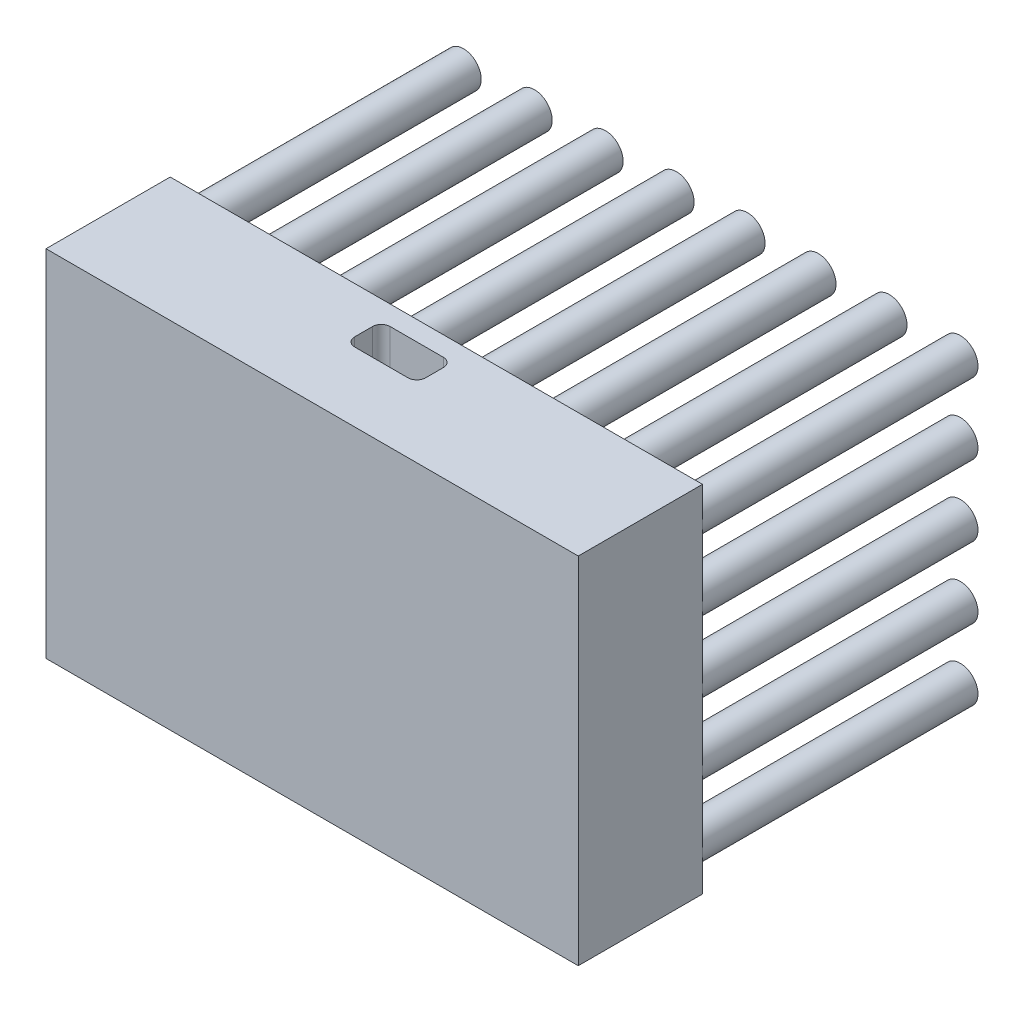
ISO-10303-21;
HEADER;
FILE_DESCRIPTION(('STEP AP214'),'2;1');
FILE_NAME('part.step','',(''),(''),'','','');
FILE_SCHEMA(('AUTOMOTIVE_DESIGN { 1 0 10303 214 1 1 1 1 }'));
ENDSEC;
DATA;
#1=APPLICATION_CONTEXT('core data for automotive mechanical design processes');
#2=APPLICATION_PROTOCOL_DEFINITION('international standard','automotive_design',2000,#1);
#3=PRODUCT_CONTEXT('',#1,'mechanical');
#4=PRODUCT('Part','Part','',(#3));
#5=PRODUCT_RELATED_PRODUCT_CATEGORY('part','',(#4));
#6=PRODUCT_DEFINITION_FORMATION('','',#4);
#7=PRODUCT_DEFINITION_CONTEXT('part definition',#1,'design');
#8=PRODUCT_DEFINITION('design','',#6,#7);
#9=PRODUCT_DEFINITION_SHAPE('','',#8);
#10=(LENGTH_UNIT() NAMED_UNIT(*) SI_UNIT(.MILLI.,.METRE.));
#11=(NAMED_UNIT(*) PLANE_ANGLE_UNIT() SI_UNIT($,.RADIAN.));
#12=(NAMED_UNIT(*) SI_UNIT($,.STERADIAN.) SOLID_ANGLE_UNIT());
#13=UNCERTAINTY_MEASURE_WITH_UNIT(LENGTH_MEASURE(1.E-05),#10,'distance_accuracy_value','');
#14=(GEOMETRIC_REPRESENTATION_CONTEXT(3) GLOBAL_UNCERTAINTY_ASSIGNED_CONTEXT((#13)) GLOBAL_UNIT_ASSIGNED_CONTEXT((#10,
#11,#12)) REPRESENTATION_CONTEXT('',''));
#15=CARTESIAN_POINT('',(0.,0.,0.));
#16=DIRECTION('',(0.,0.,1.));
#17=DIRECTION('',(1.,0.,0.));
#18=AXIS2_PLACEMENT_3D('',#15,#16,#17);
#19=CARTESIAN_POINT('',(0.,0.,7.));
#20=DIRECTION('',(-1.,0.,0.));
#21=DIRECTION('',(0.,0.,1.));
#22=AXIS2_PLACEMENT_3D('',#19,#20,#21);
#23=PLANE('',#22);
#24=DIRECTION('',(0.,1.,0.));
#25=VECTOR('',#24,1.);
#26=CARTESIAN_POINT('',(0.,0.,0.));
#27=LINE('',#26,#25);
#28=CARTESIAN_POINT('',(0.,0.,0.));
#29=VERTEX_POINT('',#28);
#30=CARTESIAN_POINT('',(0.,2.,0.));
#31=VERTEX_POINT('',#30);
#32=EDGE_CURVE('E508',#29,#31,#27,.T.);
#33=ORIENTED_EDGE('',*,*,#32,.T.);
#34=CARTESIAN_POINT('',(0.,6.,0.));
#35=VERTEX_POINT('',#34);
#36=EDGE_CURVE('E509',#31,#35,#27,.T.);
#37=ORIENTED_EDGE('',*,*,#36,.T.);
#38=CARTESIAN_POINT('',(0.,10.,0.));
#39=VERTEX_POINT('',#38);
#40=EDGE_CURVE('E513',#35,#39,#27,.T.);
#41=ORIENTED_EDGE('',*,*,#40,.T.);
#42=CARTESIAN_POINT('',(0.,14.,0.));
#43=VERTEX_POINT('',#42);
#44=EDGE_CURVE('E517',#39,#43,#27,.T.);
#45=ORIENTED_EDGE('',*,*,#44,.T.);
#46=CARTESIAN_POINT('',(0.,18.,0.));
#47=VERTEX_POINT('',#46);
#48=EDGE_CURVE('E514',#43,#47,#27,.T.);
#49=ORIENTED_EDGE('',*,*,#48,.T.);
#50=CARTESIAN_POINT('',(0.,20.,0.));
#51=VERTEX_POINT('',#50);
#52=EDGE_CURVE('E499',#47,#51,#27,.T.);
#53=ORIENTED_EDGE('',*,*,#52,.T.);
#54=DIRECTION('',(0.,0.,-1.));
#55=VECTOR('',#54,1.);
#56=CARTESIAN_POINT('',(0.,20.,7.));
#57=LINE('',#56,#55);
#58=CARTESIAN_POINT('',(0.,20.,7.));
#59=VERTEX_POINT('',#58);
#60=EDGE_CURVE('E197',#59,#51,#57,.T.);
#61=ORIENTED_EDGE('',*,*,#60,.F.);
#62=DIRECTION('',(0.,1.,0.));
#63=VECTOR('',#62,1.);
#64=CARTESIAN_POINT('',(0.,0.,7.));
#65=LINE('',#64,#63);
#66=CARTESIAN_POINT('',(0.,0.,7.));
#67=VERTEX_POINT('',#66);
#68=EDGE_CURVE('E188',#67,#59,#65,.T.);
#69=ORIENTED_EDGE('',*,*,#68,.F.);
#70=DIRECTION('',(0.,0.,-1.));
#71=VECTOR('',#70,1.);
#72=CARTESIAN_POINT('',(0.,0.,7.));
#73=LINE('',#72,#71);
#74=EDGE_CURVE('E189',#67,#29,#73,.T.);
#75=ORIENTED_EDGE('',*,*,#74,.T.);
#76=EDGE_LOOP('',(#33,#37,#41,#45,#49,#53,#61,#69,#75));
#77=FACE_BOUND('',#76,.T.);
#78=ADVANCED_FACE('F43',(#77),#23,.F.);
#79=CARTESIAN_POINT('',(0.,20.,7.));
#80=DIRECTION('',(0.,-1.,0.));
#81=DIRECTION('',(1.,0.,0.));
#82=AXIS2_PLACEMENT_3D('',#79,#80,#81);
#83=PLANE('',#82);
#84=DIRECTION('',(0.,0.,-1.));
#85=VECTOR('',#84,1.);
#86=CARTESIAN_POINT('',(-17.,20.,1.1));
#87=LINE('',#86,#85);
#88=CARTESIAN_POINT('',(-17.,20.,2.6));
#89=VERTEX_POINT('',#88);
#90=CARTESIAN_POINT('',(-17.,20.,1.6));
#91=VERTEX_POINT('',#90);
#92=EDGE_CURVE('E342',#89,#91,#87,.T.);
#93=ORIENTED_EDGE('',*,*,#92,.T.);
#94=CARTESIAN_POINT('',(-16.5,20.,1.6));
#95=DIRECTION('',(0.,-1.,0.));
#96=DIRECTION('',(1.,0.,0.));
#97=AXIS2_PLACEMENT_3D('',#94,#95,#96);
#98=CIRCLE('',#97,0.5);
#99=CARTESIAN_POINT('',(-16.5,20.,1.1));
#100=VERTEX_POINT('',#99);
#101=EDGE_CURVE('E11',#91,#100,#98,.T.);
#102=ORIENTED_EDGE('',*,*,#101,.T.);
#103=DIRECTION('',(1.,0.,0.));
#104=VECTOR('',#103,1.);
#105=CARTESIAN_POINT('',(-13.,20.,1.1));
#106=LINE('',#105,#104);
#107=CARTESIAN_POINT('',(-13.5,20.,1.1));
#108=VERTEX_POINT('',#107);
#109=EDGE_CURVE('E339',#100,#108,#106,.T.);
#110=ORIENTED_EDGE('',*,*,#109,.T.);
#111=CARTESIAN_POINT('',(-13.5,20.,1.6));
#112=DIRECTION('',(0.,-1.,0.));
#113=DIRECTION('',(1.,0.,0.));
#114=AXIS2_PLACEMENT_3D('',#111,#112,#113);
#115=CIRCLE('',#114,0.5);
#116=CARTESIAN_POINT('',(-13.,20.,1.6));
#117=VERTEX_POINT('',#116);
#118=EDGE_CURVE('E299',#108,#117,#115,.T.);
#119=ORIENTED_EDGE('',*,*,#118,.T.);
#120=DIRECTION('',(0.,0.,1.));
#121=VECTOR('',#120,1.);
#122=CARTESIAN_POINT('',(-13.,20.,1.1));
#123=LINE('',#122,#121);
#124=CARTESIAN_POINT('',(-13.,20.,2.6));
#125=VERTEX_POINT('',#124);
#126=EDGE_CURVE('E356',#117,#125,#123,.T.);
#127=ORIENTED_EDGE('',*,*,#126,.T.);
#128=CARTESIAN_POINT('',(-13.5,20.,2.6));
#129=DIRECTION('',(0.,-1.,0.));
#130=DIRECTION('',(1.,0.,0.));
#131=AXIS2_PLACEMENT_3D('',#128,#129,#130);
#132=CIRCLE('',#131,0.5);
#133=CARTESIAN_POINT('',(-13.5,20.,3.1));
#134=VERTEX_POINT('',#133);
#135=EDGE_CURVE('E317',#125,#134,#132,.T.);
#136=ORIENTED_EDGE('',*,*,#135,.T.);
#137=DIRECTION('',(-1.,0.,0.));
#138=VECTOR('',#137,1.);
#139=CARTESIAN_POINT('',(-13.,20.,3.1));
#140=LINE('',#139,#138);
#141=CARTESIAN_POINT('',(-16.5,20.,3.1));
#142=VERTEX_POINT('',#141);
#143=EDGE_CURVE('E346',#134,#142,#140,.T.);
#144=ORIENTED_EDGE('',*,*,#143,.T.);
#145=CARTESIAN_POINT('',(-16.5,20.,2.6));
#146=DIRECTION('',(0.,-1.,0.));
#147=DIRECTION('',(1.,0.,0.));
#148=AXIS2_PLACEMENT_3D('',#145,#146,#147);
#149=CIRCLE('',#148,0.5);
#150=EDGE_CURVE('E321',#142,#89,#149,.T.);
#151=ORIENTED_EDGE('',*,*,#150,.T.);
#152=EDGE_LOOP('',(#93,#102,#110,#119,#127,#136,#144,#151));
#153=FACE_BOUND('',#152,.T.);
#154=DIRECTION('',(-1.,0.,0.));
#155=VECTOR('',#154,1.);
#156=CARTESIAN_POINT('',(0.,20.,0.));
#157=LINE('',#156,#155);
#158=CARTESIAN_POINT('',(-30.,20.,0.));
#159=VERTEX_POINT('',#158);
#160=EDGE_CURVE('E185',#51,#159,#157,.T.);
#161=ORIENTED_EDGE('',*,*,#160,.T.);
#162=DIRECTION('',(0.,0.,-1.));
#163=VECTOR('',#162,1.);
#164=CARTESIAN_POINT('',(-30.,20.,7.));
#165=LINE('',#164,#163);
#166=CARTESIAN_POINT('',(-30.,20.,7.));
#167=VERTEX_POINT('',#166);
#168=EDGE_CURVE('E168',#167,#159,#165,.T.);
#169=ORIENTED_EDGE('',*,*,#168,.F.);
#170=DIRECTION('',(-1.,0.,0.));
#171=VECTOR('',#170,1.);
#172=CARTESIAN_POINT('',(0.,20.,7.));
#173=LINE('',#172,#171);
#174=EDGE_CURVE('E504',#59,#167,#173,.T.);
#175=ORIENTED_EDGE('',*,*,#174,.F.);
#176=ORIENTED_EDGE('',*,*,#60,.T.);
#177=EDGE_LOOP('',(#161,#169,#175,#176));
#178=FACE_BOUND('',#177,.T.);
#179=ADVANCED_FACE('F544',(#153,#178),#83,.F.);
#180=CARTESIAN_POINT('',(-30.,0.,7.));
#181=DIRECTION('',(1.,0.,0.));
#182=DIRECTION('',(0.,0.,-1.));
#183=AXIS2_PLACEMENT_3D('',#180,#181,#182);
#184=PLANE('',#183);
#185=DIRECTION('',(0.,-1.,0.));
#186=VECTOR('',#185,1.);
#187=CARTESIAN_POINT('',(-30.,0.,0.));
#188=LINE('',#187,#186);
#189=CARTESIAN_POINT('',(-29.9999999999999,18.,0.));
#190=VERTEX_POINT('',#189);
#191=EDGE_CURVE('E161',#159,#190,#188,.T.);
#192=ORIENTED_EDGE('',*,*,#191,.T.);
#193=CARTESIAN_POINT('',(-30.,14.,0.));
#194=VERTEX_POINT('',#193);
#195=EDGE_CURVE('E164',#190,#194,#188,.T.);
#196=ORIENTED_EDGE('',*,*,#195,.T.);
#197=CARTESIAN_POINT('',(-30.,10.,0.));
#198=VERTEX_POINT('',#197);
#199=EDGE_CURVE('E181',#194,#198,#188,.T.);
#200=ORIENTED_EDGE('',*,*,#199,.T.);
#201=CARTESIAN_POINT('',(-30.,6.,0.));
#202=VERTEX_POINT('',#201);
#203=EDGE_CURVE('E182',#198,#202,#188,.T.);
#204=ORIENTED_EDGE('',*,*,#203,.T.);
#205=CARTESIAN_POINT('',(-30.,2.,0.));
#206=VERTEX_POINT('',#205);
#207=EDGE_CURVE('E1476',#202,#206,#188,.T.);
#208=ORIENTED_EDGE('',*,*,#207,.T.);
#209=CARTESIAN_POINT('',(-30.,0.,0.));
#210=VERTEX_POINT('',#209);
#211=EDGE_CURVE('E174',#206,#210,#188,.T.);
#212=ORIENTED_EDGE('',*,*,#211,.T.);
#213=DIRECTION('',(0.,0.,-1.));
#214=VECTOR('',#213,1.);
#215=CARTESIAN_POINT('',(-30.,0.,7.));
#216=LINE('',#215,#214);
#217=CARTESIAN_POINT('',(-30.,0.,7.));
#218=VERTEX_POINT('',#217);
#219=EDGE_CURVE('E192',#218,#210,#216,.T.);
#220=ORIENTED_EDGE('',*,*,#219,.F.);
#221=DIRECTION('',(0.,-1.,0.));
#222=VECTOR('',#221,1.);
#223=CARTESIAN_POINT('',(-30.,0.,7.));
#224=LINE('',#223,#222);
#225=EDGE_CURVE('E506',#167,#218,#224,.T.);
#226=ORIENTED_EDGE('',*,*,#225,.F.);
#227=ORIENTED_EDGE('',*,*,#168,.T.);
#228=EDGE_LOOP('',(#192,#196,#200,#204,#208,#212,#220,#226,#227));
#229=FACE_BOUND('',#228,.T.);
#230=ADVANCED_FACE('F163',(#229),#184,.F.);
#231=CARTESIAN_POINT('',(0.,0.,7.));
#232=DIRECTION('',(0.,1.,0.));
#233=DIRECTION('',(-1.,0.,0.));
#234=AXIS2_PLACEMENT_3D('',#231,#232,#233);
#235=PLANE('',#234);
#236=DIRECTION('',(-1.,0.,0.));
#237=VECTOR('',#236,1.);
#238=CARTESIAN_POINT('',(-13.,0.,3.1));
#239=LINE('',#238,#237);
#240=CARTESIAN_POINT('',(-13.5,0.,3.1));
#241=VERTEX_POINT('',#240);
#242=CARTESIAN_POINT('',(-16.5,0.,3.1));
#243=VERTEX_POINT('',#242);
#244=EDGE_CURVE('E335',#241,#243,#239,.T.);
#245=ORIENTED_EDGE('',*,*,#244,.F.);
#246=CARTESIAN_POINT('',(-13.5,0.,2.6));
#247=DIRECTION('',(0.,1.,0.));
#248=DIRECTION('',(-1.,0.,0.));
#249=AXIS2_PLACEMENT_3D('',#246,#247,#248);
#250=CIRCLE('',#249,0.5);
#251=CARTESIAN_POINT('',(-13.,0.,2.6));
#252=VERTEX_POINT('',#251);
#253=EDGE_CURVE('E315',#241,#252,#250,.T.);
#254=ORIENTED_EDGE('',*,*,#253,.T.);
#255=DIRECTION('',(0.,0.,1.));
#256=VECTOR('',#255,1.);
#257=CARTESIAN_POINT('',(-13.,0.,1.1));
#258=LINE('',#257,#256);
#259=CARTESIAN_POINT('',(-13.,0.,1.6));
#260=VERTEX_POINT('',#259);
#261=EDGE_CURVE('E350',#260,#252,#258,.T.);
#262=ORIENTED_EDGE('',*,*,#261,.F.);
#263=CARTESIAN_POINT('',(-13.5,0.,1.6));
#264=DIRECTION('',(0.,1.,0.));
#265=DIRECTION('',(-1.,0.,0.));
#266=AXIS2_PLACEMENT_3D('',#263,#264,#265);
#267=CIRCLE('',#266,0.5);
#268=CARTESIAN_POINT('',(-13.5,0.,1.1));
#269=VERTEX_POINT('',#268);
#270=EDGE_CURVE('E296',#260,#269,#267,.T.);
#271=ORIENTED_EDGE('',*,*,#270,.T.);
#272=DIRECTION('',(1.,0.,0.));
#273=VECTOR('',#272,1.);
#274=CARTESIAN_POINT('',(-13.,0.,1.1));
#275=LINE('',#274,#273);
#276=CARTESIAN_POINT('',(-16.5,0.,1.1));
#277=VERTEX_POINT('',#276);
#278=EDGE_CURVE('E330',#277,#269,#275,.T.);
#279=ORIENTED_EDGE('',*,*,#278,.F.);
#280=CARTESIAN_POINT('',(-16.5,0.,1.6));
#281=DIRECTION('',(0.,1.,0.));
#282=DIRECTION('',(-1.,0.,0.));
#283=AXIS2_PLACEMENT_3D('',#280,#281,#282);
#284=CIRCLE('',#283,0.5);
#285=CARTESIAN_POINT('',(-17.,0.,1.6));
#286=VERTEX_POINT('',#285);
#287=EDGE_CURVE('E51',#277,#286,#284,.T.);
#288=ORIENTED_EDGE('',*,*,#287,.T.);
#289=DIRECTION('',(0.,0.,-1.));
#290=VECTOR('',#289,1.);
#291=CARTESIAN_POINT('',(-17.,0.,1.1));
#292=LINE('',#291,#290);
#293=CARTESIAN_POINT('',(-17.,0.,2.6));
#294=VERTEX_POINT('',#293);
#295=EDGE_CURVE('E329',#294,#286,#292,.T.);
#296=ORIENTED_EDGE('',*,*,#295,.F.);
#297=CARTESIAN_POINT('',(-16.5,0.,2.6));
#298=DIRECTION('',(0.,1.,0.));
#299=DIRECTION('',(-1.,0.,0.));
#300=AXIS2_PLACEMENT_3D('',#297,#298,#299);
#301=CIRCLE('',#300,0.5);
#302=EDGE_CURVE('E319',#294,#243,#301,.T.);
#303=ORIENTED_EDGE('',*,*,#302,.T.);
#304=EDGE_LOOP('',(#245,#254,#262,#271,#279,#288,#296,#303));
#305=FACE_BOUND('',#304,.T.);
#306=DIRECTION('',(1.,0.,0.));
#307=VECTOR('',#306,1.);
#308=CARTESIAN_POINT('',(0.,0.,0.));
#309=LINE('',#308,#307);
#310=EDGE_CURVE('E172',#210,#29,#309,.T.);
#311=ORIENTED_EDGE('',*,*,#310,.T.);
#312=ORIENTED_EDGE('',*,*,#74,.F.);
#313=DIRECTION('',(1.,0.,0.));
#314=VECTOR('',#313,1.);
#315=CARTESIAN_POINT('',(0.,0.,7.));
#316=LINE('',#315,#314);
#317=EDGE_CURVE('E193',#218,#67,#316,.T.);
#318=ORIENTED_EDGE('',*,*,#317,.F.);
#319=ORIENTED_EDGE('',*,*,#219,.T.);
#320=EDGE_LOOP('',(#311,#312,#318,#319));
#321=FACE_BOUND('',#320,.T.);
#322=ADVANCED_FACE('F327',(#305,#321),#235,.F.);
#323=CARTESIAN_POINT('',(0.,0.,7.));
#324=DIRECTION('',(0.,0.,1.));
#325=DIRECTION('',(1.,0.,0.));
#326=AXIS2_PLACEMENT_3D('',#323,#324,#325);
#327=PLANE('',#326);
#328=ORIENTED_EDGE('',*,*,#68,.T.);
#329=ORIENTED_EDGE('',*,*,#174,.T.);
#330=ORIENTED_EDGE('',*,*,#225,.T.);
#331=ORIENTED_EDGE('',*,*,#317,.T.);
#332=EDGE_LOOP('',(#328,#329,#330,#331));
#333=FACE_BOUND('',#332,.T.);
#334=ADVANCED_FACE('F828',(#333),#327,.T.);
#335=CARTESIAN_POINT('',(0.,0.,0.));
#336=DIRECTION('',(0.,0.,1.));
#337=DIRECTION('',(1.,0.,0.));
#338=AXIS2_PLACEMENT_3D('',#335,#336,#337);
#339=PLANE('',#338);
#340=CARTESIAN_POINT('',(-24.9999999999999,18.,0.));
#341=DIRECTION('',(0.,0.,1.));
#342=DIRECTION('',(1.,0.,0.));
#343=AXIS2_PLACEMENT_3D('',#340,#341,#342);
#344=CIRCLE('',#343,0.999999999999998);
#345=CARTESIAN_POINT('',(-23.9999999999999,18.,0.));
#346=VERTEX_POINT('',#345);
#347=EDGE_CURVE('E287',#346,#346,#344,.F.);
#348=ORIENTED_EDGE('',*,*,#347,.F.);
#349=EDGE_LOOP('',(#348));
#350=FACE_BOUND('',#349,.T.);
#351=CARTESIAN_POINT('',(-25.,14.,0.));
#352=DIRECTION('',(0.,0.,1.));
#353=DIRECTION('',(1.,0.,0.));
#354=AXIS2_PLACEMENT_3D('',#351,#352,#353);
#355=CIRCLE('',#354,0.999999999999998);
#356=CARTESIAN_POINT('',(-24.,14.,0.));
#357=VERTEX_POINT('',#356);
#358=EDGE_CURVE('E284',#357,#357,#355,.F.);
#359=ORIENTED_EDGE('',*,*,#358,.F.);
#360=EDGE_LOOP('',(#359));
#361=FACE_BOUND('',#360,.T.);
#362=CARTESIAN_POINT('',(-25.,10.,0.));
#363=DIRECTION('',(0.,0.,1.));
#364=DIRECTION('',(1.,0.,0.));
#365=AXIS2_PLACEMENT_3D('',#362,#363,#364);
#366=CIRCLE('',#365,0.999999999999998);
#367=CARTESIAN_POINT('',(-24.,10.,0.));
#368=VERTEX_POINT('',#367);
#369=EDGE_CURVE('E281',#368,#368,#366,.F.);
#370=ORIENTED_EDGE('',*,*,#369,.F.);
#371=EDGE_LOOP('',(#370));
#372=FACE_BOUND('',#371,.T.);
#373=CARTESIAN_POINT('',(-25.,6.,0.));
#374=DIRECTION('',(0.,0.,1.));
#375=DIRECTION('',(1.,0.,0.));
#376=AXIS2_PLACEMENT_3D('',#373,#374,#375);
#377=CIRCLE('',#376,0.999999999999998);
#378=CARTESIAN_POINT('',(-24.,6.,0.));
#379=VERTEX_POINT('',#378);
#380=EDGE_CURVE('E278',#379,#379,#377,.F.);
#381=ORIENTED_EDGE('',*,*,#380,.F.);
#382=EDGE_LOOP('',(#381));
#383=FACE_BOUND('',#382,.T.);
#384=CARTESIAN_POINT('',(-20.9999999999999,18.,0.));
#385=DIRECTION('',(0.,0.,1.));
#386=DIRECTION('',(1.,0.,0.));
#387=AXIS2_PLACEMENT_3D('',#384,#385,#386);
#388=CIRCLE('',#387,0.999999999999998);
#389=CARTESIAN_POINT('',(-19.9999999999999,18.,0.));
#390=VERTEX_POINT('',#389);
#391=EDGE_CURVE('E275',#390,#390,#388,.F.);
#392=ORIENTED_EDGE('',*,*,#391,.F.);
#393=EDGE_LOOP('',(#392));
#394=FACE_BOUND('',#393,.T.);
#395=CARTESIAN_POINT('',(-21.,14.,0.));
#396=DIRECTION('',(0.,0.,1.));
#397=DIRECTION('',(1.,0.,0.));
#398=AXIS2_PLACEMENT_3D('',#395,#396,#397);
#399=CIRCLE('',#398,0.999999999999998);
#400=CARTESIAN_POINT('',(-20.,14.,0.));
#401=VERTEX_POINT('',#400);
#402=EDGE_CURVE('E272',#401,#401,#399,.F.);
#403=ORIENTED_EDGE('',*,*,#402,.F.);
#404=EDGE_LOOP('',(#403));
#405=FACE_BOUND('',#404,.T.);
#406=CARTESIAN_POINT('',(-21.,10.,0.));
#407=DIRECTION('',(0.,0.,1.));
#408=DIRECTION('',(1.,0.,0.));
#409=AXIS2_PLACEMENT_3D('',#406,#407,#408);
#410=CIRCLE('',#409,1.);
#411=CARTESIAN_POINT('',(-20.,10.,0.));
#412=VERTEX_POINT('',#411);
#413=EDGE_CURVE('E269',#412,#412,#410,.F.);
#414=ORIENTED_EDGE('',*,*,#413,.F.);
#415=EDGE_LOOP('',(#414));
#416=FACE_BOUND('',#415,.T.);
#417=CARTESIAN_POINT('',(-21.,6.,0.));
#418=DIRECTION('',(0.,0.,1.));
#419=DIRECTION('',(1.,0.,0.));
#420=AXIS2_PLACEMENT_3D('',#417,#418,#419);
#421=CIRCLE('',#420,0.999999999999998);
#422=CARTESIAN_POINT('',(-20.,6.,0.));
#423=VERTEX_POINT('',#422);
#424=EDGE_CURVE('E266',#423,#423,#421,.F.);
#425=ORIENTED_EDGE('',*,*,#424,.F.);
#426=EDGE_LOOP('',(#425));
#427=FACE_BOUND('',#426,.T.);
#428=CARTESIAN_POINT('',(-16.9999999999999,18.,0.));
#429=DIRECTION('',(0.,0.,1.));
#430=DIRECTION('',(1.,0.,0.));
#431=AXIS2_PLACEMENT_3D('',#428,#429,#430);
#432=CIRCLE('',#431,0.999999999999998);
#433=CARTESIAN_POINT('',(-15.9999999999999,18.,0.));
#434=VERTEX_POINT('',#433);
#435=EDGE_CURVE('E263',#434,#434,#432,.F.);
#436=ORIENTED_EDGE('',*,*,#435,.F.);
#437=EDGE_LOOP('',(#436));
#438=FACE_BOUND('',#437,.T.);
#439=CARTESIAN_POINT('',(-17.,14.,0.));
#440=DIRECTION('',(0.,0.,1.));
#441=DIRECTION('',(1.,0.,0.));
#442=AXIS2_PLACEMENT_3D('',#439,#440,#441);
#443=CIRCLE('',#442,0.999999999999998);
#444=CARTESIAN_POINT('',(-16.,14.,0.));
#445=VERTEX_POINT('',#444);
#446=EDGE_CURVE('E260',#445,#445,#443,.F.);
#447=ORIENTED_EDGE('',*,*,#446,.F.);
#448=EDGE_LOOP('',(#447));
#449=FACE_BOUND('',#448,.T.);
#450=CARTESIAN_POINT('',(-17.,10.,0.));
#451=DIRECTION('',(0.,0.,1.));
#452=DIRECTION('',(1.,0.,0.));
#453=AXIS2_PLACEMENT_3D('',#450,#451,#452);
#454=CIRCLE('',#453,0.999999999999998);
#455=CARTESIAN_POINT('',(-16.,10.,0.));
#456=VERTEX_POINT('',#455);
#457=EDGE_CURVE('E257',#456,#456,#454,.F.);
#458=ORIENTED_EDGE('',*,*,#457,.F.);
#459=EDGE_LOOP('',(#458));
#460=FACE_BOUND('',#459,.T.);
#461=CARTESIAN_POINT('',(-17.,6.,0.));
#462=DIRECTION('',(0.,0.,1.));
#463=DIRECTION('',(1.,0.,0.));
#464=AXIS2_PLACEMENT_3D('',#461,#462,#463);
#465=CIRCLE('',#464,0.999999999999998);
#466=CARTESIAN_POINT('',(-16.,6.,0.));
#467=VERTEX_POINT('',#466);
#468=EDGE_CURVE('E254',#467,#467,#465,.F.);
#469=ORIENTED_EDGE('',*,*,#468,.F.);
#470=EDGE_LOOP('',(#469));
#471=FACE_BOUND('',#470,.T.);
#472=CARTESIAN_POINT('',(-12.9999999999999,18.,0.));
#473=DIRECTION('',(0.,0.,1.));
#474=DIRECTION('',(1.,0.,0.));
#475=AXIS2_PLACEMENT_3D('',#472,#473,#474);
#476=CIRCLE('',#475,1.);
#477=CARTESIAN_POINT('',(-11.9999999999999,18.,0.));
#478=VERTEX_POINT('',#477);
#479=EDGE_CURVE('E251',#478,#478,#476,.F.);
#480=ORIENTED_EDGE('',*,*,#479,.F.);
#481=EDGE_LOOP('',(#480));
#482=FACE_BOUND('',#481,.T.);
#483=CARTESIAN_POINT('',(-13.,14.,0.));
#484=DIRECTION('',(0.,0.,1.));
#485=DIRECTION('',(1.,0.,0.));
#486=AXIS2_PLACEMENT_3D('',#483,#484,#485);
#487=CIRCLE('',#486,1.);
#488=CARTESIAN_POINT('',(-12.,14.,0.));
#489=VERTEX_POINT('',#488);
#490=EDGE_CURVE('E248',#489,#489,#487,.F.);
#491=ORIENTED_EDGE('',*,*,#490,.F.);
#492=EDGE_LOOP('',(#491));
#493=FACE_BOUND('',#492,.T.);
#494=CARTESIAN_POINT('',(-13.,10.,0.));
#495=DIRECTION('',(0.,0.,1.));
#496=DIRECTION('',(1.,0.,0.));
#497=AXIS2_PLACEMENT_3D('',#494,#495,#496);
#498=CIRCLE('',#497,1.);
#499=CARTESIAN_POINT('',(-12.,10.,0.));
#500=VERTEX_POINT('',#499);
#501=EDGE_CURVE('E245',#500,#500,#498,.F.);
#502=ORIENTED_EDGE('',*,*,#501,.F.);
#503=EDGE_LOOP('',(#502));
#504=FACE_BOUND('',#503,.T.);
#505=CARTESIAN_POINT('',(-13.,6.,0.));
#506=DIRECTION('',(0.,0.,1.));
#507=DIRECTION('',(1.,0.,0.));
#508=AXIS2_PLACEMENT_3D('',#505,#506,#507);
#509=CIRCLE('',#508,1.);
#510=CARTESIAN_POINT('',(-12.,6.,0.));
#511=VERTEX_POINT('',#510);
#512=EDGE_CURVE('E242',#511,#511,#509,.F.);
#513=ORIENTED_EDGE('',*,*,#512,.F.);
#514=EDGE_LOOP('',(#513));
#515=FACE_BOUND('',#514,.T.);
#516=CARTESIAN_POINT('',(-8.99999999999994,18.,0.));
#517=DIRECTION('',(0.,0.,1.));
#518=DIRECTION('',(1.,0.,0.));
#519=AXIS2_PLACEMENT_3D('',#516,#517,#518);
#520=CIRCLE('',#519,1.);
#521=CARTESIAN_POINT('',(-7.99999999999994,18.,0.));
#522=VERTEX_POINT('',#521);
#523=EDGE_CURVE('E239',#522,#522,#520,.F.);
#524=ORIENTED_EDGE('',*,*,#523,.F.);
#525=EDGE_LOOP('',(#524));
#526=FACE_BOUND('',#525,.T.);
#527=CARTESIAN_POINT('',(-8.99999999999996,14.,0.));
#528=DIRECTION('',(0.,0.,1.));
#529=DIRECTION('',(1.,0.,0.));
#530=AXIS2_PLACEMENT_3D('',#527,#528,#529);
#531=CIRCLE('',#530,1.);
#532=CARTESIAN_POINT('',(-7.99999999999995,14.,0.));
#533=VERTEX_POINT('',#532);
#534=EDGE_CURVE('E236',#533,#533,#531,.F.);
#535=ORIENTED_EDGE('',*,*,#534,.F.);
#536=EDGE_LOOP('',(#535));
#537=FACE_BOUND('',#536,.T.);
#538=CARTESIAN_POINT('',(-8.99999999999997,10.,0.));
#539=DIRECTION('',(0.,0.,1.));
#540=DIRECTION('',(1.,0.,0.));
#541=AXIS2_PLACEMENT_3D('',#538,#539,#540);
#542=CIRCLE('',#541,1.);
#543=CARTESIAN_POINT('',(-7.99999999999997,10.,0.));
#544=VERTEX_POINT('',#543);
#545=EDGE_CURVE('E233',#544,#544,#542,.F.);
#546=ORIENTED_EDGE('',*,*,#545,.F.);
#547=EDGE_LOOP('',(#546));
#548=FACE_BOUND('',#547,.T.);
#549=CARTESIAN_POINT('',(-8.99999999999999,6.,0.));
#550=DIRECTION('',(0.,0.,1.));
#551=DIRECTION('',(1.,0.,0.));
#552=AXIS2_PLACEMENT_3D('',#549,#550,#551);
#553=CIRCLE('',#552,1.);
#554=CARTESIAN_POINT('',(-7.99999999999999,6.,0.));
#555=VERTEX_POINT('',#554);
#556=EDGE_CURVE('E230',#555,#555,#553,.F.);
#557=ORIENTED_EDGE('',*,*,#556,.F.);
#558=EDGE_LOOP('',(#557));
#559=FACE_BOUND('',#558,.T.);
#560=CARTESIAN_POINT('',(-4.99999999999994,18.,0.));
#561=DIRECTION('',(0.,0.,1.));
#562=DIRECTION('',(1.,0.,0.));
#563=AXIS2_PLACEMENT_3D('',#560,#561,#562);
#564=CIRCLE('',#563,1.);
#565=CARTESIAN_POINT('',(-3.99999999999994,18.,0.));
#566=VERTEX_POINT('',#565);
#567=EDGE_CURVE('E227',#566,#566,#564,.F.);
#568=ORIENTED_EDGE('',*,*,#567,.F.);
#569=EDGE_LOOP('',(#568));
#570=FACE_BOUND('',#569,.T.);
#571=CARTESIAN_POINT('',(-4.99999999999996,14.,0.));
#572=DIRECTION('',(0.,0.,1.));
#573=DIRECTION('',(1.,0.,0.));
#574=AXIS2_PLACEMENT_3D('',#571,#572,#573);
#575=CIRCLE('',#574,1.);
#576=CARTESIAN_POINT('',(-3.99999999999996,14.,0.));
#577=VERTEX_POINT('',#576);
#578=EDGE_CURVE('E224',#577,#577,#575,.F.);
#579=ORIENTED_EDGE('',*,*,#578,.F.);
#580=EDGE_LOOP('',(#579));
#581=FACE_BOUND('',#580,.T.);
#582=CARTESIAN_POINT('',(-4.99999999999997,10.,0.));
#583=DIRECTION('',(0.,0.,1.));
#584=DIRECTION('',(1.,0.,0.));
#585=AXIS2_PLACEMENT_3D('',#582,#583,#584);
#586=CIRCLE('',#585,1.);
#587=CARTESIAN_POINT('',(-3.99999999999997,10.,0.));
#588=VERTEX_POINT('',#587);
#589=EDGE_CURVE('E221',#588,#588,#586,.F.);
#590=ORIENTED_EDGE('',*,*,#589,.F.);
#591=EDGE_LOOP('',(#590));
#592=FACE_BOUND('',#591,.T.);
#593=CARTESIAN_POINT('',(-4.99999999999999,6.,0.));
#594=DIRECTION('',(0.,0.,1.));
#595=DIRECTION('',(1.,0.,0.));
#596=AXIS2_PLACEMENT_3D('',#593,#594,#595);
#597=CIRCLE('',#596,1.);
#598=CARTESIAN_POINT('',(-3.99999999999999,6.,0.));
#599=VERTEX_POINT('',#598);
#600=EDGE_CURVE('E218',#599,#599,#597,.F.);
#601=ORIENTED_EDGE('',*,*,#600,.F.);
#602=EDGE_LOOP('',(#601));
#603=FACE_BOUND('',#602,.T.);
#604=CARTESIAN_POINT('',(-25.,2.,0.));
#605=DIRECTION('',(0.,0.,1.));
#606=DIRECTION('',(1.,0.,0.));
#607=AXIS2_PLACEMENT_3D('',#604,#605,#606);
#608=CIRCLE('',#607,1.);
#609=CARTESIAN_POINT('',(-24.,2.,0.));
#610=VERTEX_POINT('',#609);
#611=EDGE_CURVE('E215',#610,#610,#608,.F.);
#612=ORIENTED_EDGE('',*,*,#611,.F.);
#613=EDGE_LOOP('',(#612));
#614=FACE_BOUND('',#613,.T.);
#615=CARTESIAN_POINT('',(-21.,2.,0.));
#616=DIRECTION('',(0.,0.,1.));
#617=DIRECTION('',(1.,0.,0.));
#618=AXIS2_PLACEMENT_3D('',#615,#616,#617);
#619=CIRCLE('',#618,1.);
#620=CARTESIAN_POINT('',(-20.,2.,0.));
#621=VERTEX_POINT('',#620);
#622=EDGE_CURVE('E212',#621,#621,#619,.F.);
#623=ORIENTED_EDGE('',*,*,#622,.F.);
#624=EDGE_LOOP('',(#623));
#625=FACE_BOUND('',#624,.T.);
#626=CARTESIAN_POINT('',(-17.,2.,0.));
#627=DIRECTION('',(0.,0.,1.));
#628=DIRECTION('',(1.,0.,0.));
#629=AXIS2_PLACEMENT_3D('',#626,#627,#628);
#630=CIRCLE('',#629,1.);
#631=CARTESIAN_POINT('',(-16.,2.,0.));
#632=VERTEX_POINT('',#631);
#633=EDGE_CURVE('E209',#632,#632,#630,.F.);
#634=ORIENTED_EDGE('',*,*,#633,.F.);
#635=EDGE_LOOP('',(#634));
#636=FACE_BOUND('',#635,.T.);
#637=CARTESIAN_POINT('',(-13.,2.,0.));
#638=DIRECTION('',(0.,0.,1.));
#639=DIRECTION('',(1.,0.,0.));
#640=AXIS2_PLACEMENT_3D('',#637,#638,#639);
#641=CIRCLE('',#640,1.);
#642=CARTESIAN_POINT('',(-12.,2.,0.));
#643=VERTEX_POINT('',#642);
#644=EDGE_CURVE('E206',#643,#643,#641,.F.);
#645=ORIENTED_EDGE('',*,*,#644,.F.);
#646=EDGE_LOOP('',(#645));
#647=FACE_BOUND('',#646,.T.);
#648=CARTESIAN_POINT('',(-9.,2.,0.));
#649=DIRECTION('',(0.,0.,1.));
#650=DIRECTION('',(1.,0.,0.));
#651=AXIS2_PLACEMENT_3D('',#648,#649,#650);
#652=CIRCLE('',#651,1.);
#653=CARTESIAN_POINT('',(-8.,2.,0.));
#654=VERTEX_POINT('',#653);
#655=EDGE_CURVE('E203',#654,#654,#652,.F.);
#656=ORIENTED_EDGE('',*,*,#655,.F.);
#657=EDGE_LOOP('',(#656));
#658=FACE_BOUND('',#657,.T.);
#659=CARTESIAN_POINT('',(-5.,2.,0.));
#660=DIRECTION('',(0.,0.,1.));
#661=DIRECTION('',(1.,0.,0.));
#662=AXIS2_PLACEMENT_3D('',#659,#660,#661);
#663=CIRCLE('',#662,1.);
#664=CARTESIAN_POINT('',(-4.,2.,0.));
#665=VERTEX_POINT('',#664);
#666=EDGE_CURVE('E200',#665,#665,#663,.F.);
#667=ORIENTED_EDGE('',*,*,#666,.F.);
#668=EDGE_LOOP('',(#667));
#669=FACE_BOUND('',#668,.T.);
#670=ORIENTED_EDGE('',*,*,#195,.F.);
#671=CARTESIAN_POINT('',(-28.9999999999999,18.,0.));
#672=DIRECTION('',(0.,0.,-1.));
#673=DIRECTION('',(-1.,0.,0.));
#674=AXIS2_PLACEMENT_3D('',#671,#672,#673);
#675=CIRCLE('',#674,0.999999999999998);
#676=EDGE_CURVE('E178',#190,#190,#675,.T.);
#677=ORIENTED_EDGE('',*,*,#676,.F.);
#678=ORIENTED_EDGE('',*,*,#191,.F.);
#679=ORIENTED_EDGE('',*,*,#160,.F.);
#680=ORIENTED_EDGE('',*,*,#52,.F.);
#681=CARTESIAN_POINT('',(-0.999999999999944,18.,0.));
#682=DIRECTION('',(0.,0.,-1.));
#683=DIRECTION('',(-1.,0.,0.));
#684=AXIS2_PLACEMENT_3D('',#681,#682,#683);
#685=CIRCLE('',#684,1.);
#686=EDGE_CURVE('E447',#47,#47,#685,.T.);
#687=ORIENTED_EDGE('',*,*,#686,.F.);
#688=ORIENTED_EDGE('',*,*,#48,.F.);
#689=CARTESIAN_POINT('',(-0.999999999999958,14.,0.));
#690=DIRECTION('',(0.,0.,-1.));
#691=DIRECTION('',(-1.,0.,0.));
#692=AXIS2_PLACEMENT_3D('',#689,#690,#691);
#693=CIRCLE('',#692,1.);
#694=EDGE_CURVE('E451',#43,#43,#693,.T.);
#695=ORIENTED_EDGE('',*,*,#694,.F.);
#696=ORIENTED_EDGE('',*,*,#44,.F.);
#697=CARTESIAN_POINT('',(-0.999999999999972,10.,0.));
#698=DIRECTION('',(0.,0.,-1.));
#699=DIRECTION('',(-1.,0.,0.));
#700=AXIS2_PLACEMENT_3D('',#697,#698,#699);
#701=CIRCLE('',#700,1.);
#702=EDGE_CURVE('E457',#39,#39,#701,.T.);
#703=ORIENTED_EDGE('',*,*,#702,.F.);
#704=ORIENTED_EDGE('',*,*,#40,.F.);
#705=CARTESIAN_POINT('',(-0.999999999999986,6.,0.));
#706=DIRECTION('',(0.,0.,-1.));
#707=DIRECTION('',(-1.,0.,0.));
#708=AXIS2_PLACEMENT_3D('',#705,#706,#707);
#709=CIRCLE('',#708,1.);
#710=EDGE_CURVE('E463',#35,#35,#709,.T.);
#711=ORIENTED_EDGE('',*,*,#710,.F.);
#712=ORIENTED_EDGE('',*,*,#36,.F.);
#713=CARTESIAN_POINT('',(-1.,2.,0.));
#714=DIRECTION('',(0.,0.,-1.));
#715=DIRECTION('',(-1.,0.,0.));
#716=AXIS2_PLACEMENT_3D('',#713,#714,#715);
#717=CIRCLE('',#716,1.);
#718=EDGE_CURVE('E495',#31,#31,#717,.T.);
#719=ORIENTED_EDGE('',*,*,#718,.F.);
#720=ORIENTED_EDGE('',*,*,#32,.F.);
#721=ORIENTED_EDGE('',*,*,#310,.F.);
#722=ORIENTED_EDGE('',*,*,#211,.F.);
#723=CARTESIAN_POINT('',(-29.,2.,0.));
#724=DIRECTION('',(0.,0.,-1.));
#725=DIRECTION('',(-1.,0.,0.));
#726=AXIS2_PLACEMENT_3D('',#723,#724,#725);
#727=CIRCLE('',#726,1.);
#728=EDGE_CURVE('E469',#206,#206,#727,.T.);
#729=ORIENTED_EDGE('',*,*,#728,.F.);
#730=ORIENTED_EDGE('',*,*,#207,.F.);
#731=CARTESIAN_POINT('',(-29.,6.,0.));
#732=DIRECTION('',(0.,0.,-1.));
#733=DIRECTION('',(-1.,0.,0.));
#734=AXIS2_PLACEMENT_3D('',#731,#732,#733);
#735=CIRCLE('',#734,0.999999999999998);
#736=EDGE_CURVE('E367',#202,#202,#735,.T.);
#737=ORIENTED_EDGE('',*,*,#736,.F.);
#738=ORIENTED_EDGE('',*,*,#203,.F.);
#739=CARTESIAN_POINT('',(-29.,10.,0.));
#740=DIRECTION('',(0.,0.,-1.));
#741=DIRECTION('',(-1.,0.,0.));
#742=AXIS2_PLACEMENT_3D('',#739,#740,#741);
#743=CIRCLE('',#742,1.);
#744=EDGE_CURVE('E362',#198,#198,#743,.T.);
#745=ORIENTED_EDGE('',*,*,#744,.F.);
#746=ORIENTED_EDGE('',*,*,#199,.F.);
#747=CARTESIAN_POINT('',(-29.,14.,0.));
#748=DIRECTION('',(0.,0.,-1.));
#749=DIRECTION('',(-1.,0.,0.));
#750=AXIS2_PLACEMENT_3D('',#747,#748,#749);
#751=CIRCLE('',#750,0.999999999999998);
#752=EDGE_CURVE('E180',#194,#194,#751,.T.);
#753=ORIENTED_EDGE('',*,*,#752,.F.);
#754=EDGE_LOOP('',(#670,#677,#678,#679,#680,#687,#688,#695,#696,#703,#704,#711,#712,#719,#720,
#721,#722,#729,#730,#737,#738,#745,#746,#753));
#755=FACE_BOUND('',#754,.T.);
#756=ADVANCED_FACE('F176',(#350,#361,#372,#383,#394,#405,#416,#427,#438,#449,#460,#471,#482,
#493,#504,#515,#526,#537,#548,#559,#570,#581,#592,#603,#614,#625,#636,#647,#658,#669,#755),#339,.F.);
#757=CARTESIAN_POINT('',(-1.,2.,-15.53));
#758=DIRECTION('',(0.,0.,1.));
#759=DIRECTION('',(1.,0.,0.));
#760=AXIS2_PLACEMENT_3D('',#757,#758,#759);
#761=CYLINDRICAL_SURFACE('',#760,1.);
#762=CARTESIAN_POINT('',(-1.,2.,-15.53));
#763=DIRECTION('',(0.,0.,-1.));
#764=DIRECTION('',(-1.,0.,0.));
#765=AXIS2_PLACEMENT_3D('',#762,#763,#764);
#766=CIRCLE('',#765,1.);
#767=CARTESIAN_POINT('',(-2.,2.,-15.53));
#768=VERTEX_POINT('',#767);
#769=EDGE_CURVE('E496',#768,#768,#766,.T.);
#770=ORIENTED_EDGE('',*,*,#769,.F.);
#771=EDGE_LOOP('',(#770));
#772=FACE_BOUND('',#771,.T.);
#773=ORIENTED_EDGE('',*,*,#718,.T.);
#774=EDGE_LOOP('',(#773));
#775=FACE_BOUND('',#774,.T.);
#776=ADVANCED_FACE('F836',(#772,#775),#761,.T.);
#777=CARTESIAN_POINT('',(-1.,2.,-15.53));
#778=DIRECTION('',(0.,0.,-1.));
#779=DIRECTION('',(-1.,0.,0.));
#780=AXIS2_PLACEMENT_3D('',#777,#778,#779);
#781=PLANE('',#780);
#782=ORIENTED_EDGE('',*,*,#769,.T.);
#783=EDGE_LOOP('',(#782));
#784=FACE_BOUND('',#783,.T.);
#785=ADVANCED_FACE('F838',(#784),#781,.T.);
#786=CARTESIAN_POINT('',(-5.,2.,-15.53));
#787=DIRECTION('',(0.,0.,1.));
#788=DIRECTION('',(1.,0.,0.));
#789=AXIS2_PLACEMENT_3D('',#786,#787,#788);
#790=CYLINDRICAL_SURFACE('',#789,1.);
#791=CARTESIAN_POINT('',(-5.,2.,-15.53));
#792=DIRECTION('',(0.,0.,-1.));
#793=DIRECTION('',(-1.,0.,0.));
#794=AXIS2_PLACEMENT_3D('',#791,#792,#793);
#795=CIRCLE('',#794,1.);
#796=CARTESIAN_POINT('',(-6.,2.,-15.53));
#797=VERTEX_POINT('',#796);
#798=EDGE_CURVE('E492',#797,#797,#795,.T.);
#799=ORIENTED_EDGE('',*,*,#798,.F.);
#800=EDGE_LOOP('',(#799));
#801=FACE_BOUND('',#800,.T.);
#802=ORIENTED_EDGE('',*,*,#666,.T.);
#803=EDGE_LOOP('',(#802));
#804=FACE_BOUND('',#803,.T.);
#805=ADVANCED_FACE('F845',(#801,#804),#790,.T.);
#806=CARTESIAN_POINT('',(-5.,2.,-15.53));
#807=DIRECTION('',(0.,0.,-1.));
#808=DIRECTION('',(-1.,0.,0.));
#809=AXIS2_PLACEMENT_3D('',#806,#807,#808);
#810=PLANE('',#809);
#811=ORIENTED_EDGE('',*,*,#798,.T.);
#812=EDGE_LOOP('',(#811));
#813=FACE_BOUND('',#812,.T.);
#814=ADVANCED_FACE('F897',(#813),#810,.T.);
#815=CARTESIAN_POINT('',(-9.,2.,-15.53));
#816=DIRECTION('',(0.,0.,1.));
#817=DIRECTION('',(1.,0.,0.));
#818=AXIS2_PLACEMENT_3D('',#815,#816,#817);
#819=CYLINDRICAL_SURFACE('',#818,1.);
#820=CARTESIAN_POINT('',(-9.,2.,-15.53));
#821=DIRECTION('',(0.,0.,-1.));
#822=DIRECTION('',(-1.,0.,0.));
#823=AXIS2_PLACEMENT_3D('',#820,#821,#822);
#824=CIRCLE('',#823,1.);
#825=CARTESIAN_POINT('',(-10.,2.,-15.53));
#826=VERTEX_POINT('',#825);
#827=EDGE_CURVE('E489',#826,#826,#824,.T.);
#828=ORIENTED_EDGE('',*,*,#827,.F.);
#829=EDGE_LOOP('',(#828));
#830=FACE_BOUND('',#829,.T.);
#831=ORIENTED_EDGE('',*,*,#655,.T.);
#832=EDGE_LOOP('',(#831));
#833=FACE_BOUND('',#832,.T.);
#834=ADVANCED_FACE('F906',(#830,#833),#819,.T.);
#835=CARTESIAN_POINT('',(-9.,2.,-15.53));
#836=DIRECTION('',(0.,0.,-1.));
#837=DIRECTION('',(-1.,0.,0.));
#838=AXIS2_PLACEMENT_3D('',#835,#836,#837);
#839=PLANE('',#838);
#840=ORIENTED_EDGE('',*,*,#827,.T.);
#841=EDGE_LOOP('',(#840));
#842=FACE_BOUND('',#841,.T.);
#843=ADVANCED_FACE('F916',(#842),#839,.T.);
#844=CARTESIAN_POINT('',(-13.,2.,-15.53));
#845=DIRECTION('',(0.,0.,1.));
#846=DIRECTION('',(1.,0.,0.));
#847=AXIS2_PLACEMENT_3D('',#844,#845,#846);
#848=CYLINDRICAL_SURFACE('',#847,1.);
#849=CARTESIAN_POINT('',(-13.,2.,-15.53));
#850=DIRECTION('',(0.,0.,-1.));
#851=DIRECTION('',(-1.,0.,0.));
#852=AXIS2_PLACEMENT_3D('',#849,#850,#851);
#853=CIRCLE('',#852,1.);
#854=CARTESIAN_POINT('',(-14.,2.,-15.53));
#855=VERTEX_POINT('',#854);
#856=EDGE_CURVE('E486',#855,#855,#853,.T.);
#857=ORIENTED_EDGE('',*,*,#856,.F.);
#858=EDGE_LOOP('',(#857));
#859=FACE_BOUND('',#858,.T.);
#860=ORIENTED_EDGE('',*,*,#644,.T.);
#861=EDGE_LOOP('',(#860));
#862=FACE_BOUND('',#861,.T.);
#863=ADVANCED_FACE('F926',(#859,#862),#848,.T.);
#864=CARTESIAN_POINT('',(-13.,2.,-15.53));
#865=DIRECTION('',(0.,0.,-1.));
#866=DIRECTION('',(-1.,0.,0.));
#867=AXIS2_PLACEMENT_3D('',#864,#865,#866);
#868=PLANE('',#867);
#869=ORIENTED_EDGE('',*,*,#856,.T.);
#870=EDGE_LOOP('',(#869));
#871=FACE_BOUND('',#870,.T.);
#872=ADVANCED_FACE('F936',(#871),#868,.T.);
#873=CARTESIAN_POINT('',(-17.,2.,-15.53));
#874=DIRECTION('',(0.,0.,1.));
#875=DIRECTION('',(1.,0.,0.));
#876=AXIS2_PLACEMENT_3D('',#873,#874,#875);
#877=CYLINDRICAL_SURFACE('',#876,1.);
#878=CARTESIAN_POINT('',(-17.,2.,-15.53));
#879=DIRECTION('',(0.,0.,-1.));
#880=DIRECTION('',(-1.,0.,0.));
#881=AXIS2_PLACEMENT_3D('',#878,#879,#880);
#882=CIRCLE('',#881,1.);
#883=CARTESIAN_POINT('',(-18.,2.,-15.53));
#884=VERTEX_POINT('',#883);
#885=EDGE_CURVE('E483',#884,#884,#882,.T.);
#886=ORIENTED_EDGE('',*,*,#885,.F.);
#887=EDGE_LOOP('',(#886));
#888=FACE_BOUND('',#887,.T.);
#889=ORIENTED_EDGE('',*,*,#633,.T.);
#890=EDGE_LOOP('',(#889));
#891=FACE_BOUND('',#890,.T.);
#892=ADVANCED_FACE('F946',(#888,#891),#877,.T.);
#893=CARTESIAN_POINT('',(-17.,2.,-15.53));
#894=DIRECTION('',(0.,0.,-1.));
#895=DIRECTION('',(-1.,0.,0.));
#896=AXIS2_PLACEMENT_3D('',#893,#894,#895);
#897=PLANE('',#896);
#898=ORIENTED_EDGE('',*,*,#885,.T.);
#899=EDGE_LOOP('',(#898));
#900=FACE_BOUND('',#899,.T.);
#901=ADVANCED_FACE('F956',(#900),#897,.T.);
#902=CARTESIAN_POINT('',(-21.,2.,-15.53));
#903=DIRECTION('',(0.,0.,1.));
#904=DIRECTION('',(1.,0.,0.));
#905=AXIS2_PLACEMENT_3D('',#902,#903,#904);
#906=CYLINDRICAL_SURFACE('',#905,1.);
#907=CARTESIAN_POINT('',(-21.,2.,-15.53));
#908=DIRECTION('',(0.,0.,-1.));
#909=DIRECTION('',(-1.,0.,0.));
#910=AXIS2_PLACEMENT_3D('',#907,#908,#909);
#911=CIRCLE('',#910,1.);
#912=CARTESIAN_POINT('',(-22.,2.,-15.53));
#913=VERTEX_POINT('',#912);
#914=EDGE_CURVE('E480',#913,#913,#911,.T.);
#915=ORIENTED_EDGE('',*,*,#914,.F.);
#916=EDGE_LOOP('',(#915));
#917=FACE_BOUND('',#916,.T.);
#918=ORIENTED_EDGE('',*,*,#622,.T.);
#919=EDGE_LOOP('',(#918));
#920=FACE_BOUND('',#919,.T.);
#921=ADVANCED_FACE('F966',(#917,#920),#906,.T.);
#922=CARTESIAN_POINT('',(-21.,2.,-15.53));
#923=DIRECTION('',(0.,0.,-1.));
#924=DIRECTION('',(-1.,0.,0.));
#925=AXIS2_PLACEMENT_3D('',#922,#923,#924);
#926=PLANE('',#925);
#927=ORIENTED_EDGE('',*,*,#914,.T.);
#928=EDGE_LOOP('',(#927));
#929=FACE_BOUND('',#928,.T.);
#930=ADVANCED_FACE('F976',(#929),#926,.T.);
#931=CARTESIAN_POINT('',(-25.,2.,-15.53));
#932=DIRECTION('',(0.,0.,1.));
#933=DIRECTION('',(1.,0.,0.));
#934=AXIS2_PLACEMENT_3D('',#931,#932,#933);
#935=CYLINDRICAL_SURFACE('',#934,1.);
#936=CARTESIAN_POINT('',(-25.,2.,-15.53));
#937=DIRECTION('',(0.,0.,-1.));
#938=DIRECTION('',(-1.,0.,0.));
#939=AXIS2_PLACEMENT_3D('',#936,#937,#938);
#940=CIRCLE('',#939,1.);
#941=CARTESIAN_POINT('',(-26.,2.,-15.53));
#942=VERTEX_POINT('',#941);
#943=EDGE_CURVE('E475',#942,#942,#940,.T.);
#944=ORIENTED_EDGE('',*,*,#943,.F.);
#945=EDGE_LOOP('',(#944));
#946=FACE_BOUND('',#945,.T.);
#947=ORIENTED_EDGE('',*,*,#611,.T.);
#948=EDGE_LOOP('',(#947));
#949=FACE_BOUND('',#948,.T.);
#950=ADVANCED_FACE('F986',(#946,#949),#935,.T.);
#951=CARTESIAN_POINT('',(-25.,2.,-15.53));
#952=DIRECTION('',(0.,0.,-1.));
#953=DIRECTION('',(-1.,0.,0.));
#954=AXIS2_PLACEMENT_3D('',#951,#952,#953);
#955=PLANE('',#954);
#956=ORIENTED_EDGE('',*,*,#943,.T.);
#957=EDGE_LOOP('',(#956));
#958=FACE_BOUND('',#957,.T.);
#959=ADVANCED_FACE('F996',(#958),#955,.T.);
#960=CARTESIAN_POINT('',(-29.,2.,-15.53));
#961=DIRECTION('',(0.,0.,1.));
#962=DIRECTION('',(1.,0.,0.));
#963=AXIS2_PLACEMENT_3D('',#960,#961,#962);
#964=CYLINDRICAL_SURFACE('',#963,1.);
#965=CARTESIAN_POINT('',(-29.,2.,-15.53));
#966=DIRECTION('',(0.,0.,-1.));
#967=DIRECTION('',(-1.,0.,0.));
#968=AXIS2_PLACEMENT_3D('',#965,#966,#967);
#969=CIRCLE('',#968,1.);
#970=CARTESIAN_POINT('',(-30.,2.,-15.53));
#971=VERTEX_POINT('',#970);
#972=EDGE_CURVE('E472',#971,#971,#969,.T.);
#973=ORIENTED_EDGE('',*,*,#972,.F.);
#974=EDGE_LOOP('',(#973));
#975=FACE_BOUND('',#974,.T.);
#976=ORIENTED_EDGE('',*,*,#728,.T.);
#977=EDGE_LOOP('',(#976));
#978=FACE_BOUND('',#977,.T.);
#979=ADVANCED_FACE('F1006',(#975,#978),#964,.T.);
#980=CARTESIAN_POINT('',(-29.,2.,-15.53));
#981=DIRECTION('',(0.,0.,-1.));
#982=DIRECTION('',(-1.,0.,0.));
#983=AXIS2_PLACEMENT_3D('',#980,#981,#982);
#984=PLANE('',#983);
#985=ORIENTED_EDGE('',*,*,#972,.T.);
#986=EDGE_LOOP('',(#985));
#987=FACE_BOUND('',#986,.T.);
#988=ADVANCED_FACE('F1016',(#987),#984,.T.);
#989=CARTESIAN_POINT('',(-0.999999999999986,6.,-15.53));
#990=DIRECTION('',(0.,0.,1.));
#991=DIRECTION('',(1.,0.,0.));
#992=AXIS2_PLACEMENT_3D('',#989,#990,#991);
#993=CYLINDRICAL_SURFACE('',#992,1.);
#994=CARTESIAN_POINT('',(-0.999999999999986,6.,-15.53));
#995=DIRECTION('',(0.,0.,-1.));
#996=DIRECTION('',(-1.,0.,0.));
#997=AXIS2_PLACEMENT_3D('',#994,#995,#996);
#998=CIRCLE('',#997,1.);
#999=CARTESIAN_POINT('',(-1.99999999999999,6.,-15.53));
#1000=VERTEX_POINT('',#999);
#1001=EDGE_CURVE('E466',#1000,#1000,#998,.T.);
#1002=ORIENTED_EDGE('',*,*,#1001,.F.);
#1003=EDGE_LOOP('',(#1002));
#1004=FACE_BOUND('',#1003,.T.);
#1005=ORIENTED_EDGE('',*,*,#710,.T.);
#1006=EDGE_LOOP('',(#1005));
#1007=FACE_BOUND('',#1006,.T.);
#1008=ADVANCED_FACE('F1026',(#1004,#1007),#993,.T.);
#1009=CARTESIAN_POINT('',(-0.999999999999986,6.,-15.53));
#1010=DIRECTION('',(0.,0.,-1.));
#1011=DIRECTION('',(-1.,0.,0.));
#1012=AXIS2_PLACEMENT_3D('',#1009,#1010,#1011);
#1013=PLANE('',#1012);
#1014=ORIENTED_EDGE('',*,*,#1001,.T.);
#1015=EDGE_LOOP('',(#1014));
#1016=FACE_BOUND('',#1015,.T.);
#1017=ADVANCED_FACE('F1036',(#1016),#1013,.T.);
#1018=CARTESIAN_POINT('',(-0.999999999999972,10.,-15.53));
#1019=DIRECTION('',(0.,0.,1.));
#1020=DIRECTION('',(1.,0.,0.));
#1021=AXIS2_PLACEMENT_3D('',#1018,#1019,#1020);
#1022=CYLINDRICAL_SURFACE('',#1021,1.);
#1023=CARTESIAN_POINT('',(-0.999999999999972,10.,-15.53));
#1024=DIRECTION('',(0.,0.,-1.));
#1025=DIRECTION('',(-1.,0.,0.));
#1026=AXIS2_PLACEMENT_3D('',#1023,#1024,#1025);
#1027=CIRCLE('',#1026,1.);
#1028=CARTESIAN_POINT('',(-1.99999999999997,10.,-15.53));
#1029=VERTEX_POINT('',#1028);
#1030=EDGE_CURVE('E460',#1029,#1029,#1027,.T.);
#1031=ORIENTED_EDGE('',*,*,#1030,.F.);
#1032=EDGE_LOOP('',(#1031));
#1033=FACE_BOUND('',#1032,.T.);
#1034=ORIENTED_EDGE('',*,*,#702,.T.);
#1035=EDGE_LOOP('',(#1034));
#1036=FACE_BOUND('',#1035,.T.);
#1037=ADVANCED_FACE('F539',(#1033,#1036),#1022,.T.);
#1038=CARTESIAN_POINT('',(-0.999999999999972,10.,-15.53));
#1039=DIRECTION('',(0.,0.,-1.));
#1040=DIRECTION('',(-1.,0.,0.));
#1041=AXIS2_PLACEMENT_3D('',#1038,#1039,#1040);
#1042=PLANE('',#1041);
#1043=ORIENTED_EDGE('',*,*,#1030,.T.);
#1044=EDGE_LOOP('',(#1043));
#1045=FACE_BOUND('',#1044,.T.);
#1046=ADVANCED_FACE('F529',(#1045),#1042,.T.);
#1047=CARTESIAN_POINT('',(-0.999999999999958,14.,-15.53));
#1048=DIRECTION('',(0.,0.,1.));
#1049=DIRECTION('',(1.,0.,0.));
#1050=AXIS2_PLACEMENT_3D('',#1047,#1048,#1049);
#1051=CYLINDRICAL_SURFACE('',#1050,1.);
#1052=CARTESIAN_POINT('',(-0.999999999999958,14.,-15.53));
#1053=DIRECTION('',(0.,0.,-1.));
#1054=DIRECTION('',(-1.,0.,0.));
#1055=AXIS2_PLACEMENT_3D('',#1052,#1053,#1054);
#1056=CIRCLE('',#1055,1.);
#1057=CARTESIAN_POINT('',(-1.99999999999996,14.,-15.53));
#1058=VERTEX_POINT('',#1057);
#1059=EDGE_CURVE('E454',#1058,#1058,#1056,.T.);
#1060=ORIENTED_EDGE('',*,*,#1059,.F.);
#1061=EDGE_LOOP('',(#1060));
#1062=FACE_BOUND('',#1061,.T.);
#1063=ORIENTED_EDGE('',*,*,#694,.T.);
#1064=EDGE_LOOP('',(#1063));
#1065=FACE_BOUND('',#1064,.T.);
#1066=ADVANCED_FACE('F526',(#1062,#1065),#1051,.T.);
#1067=CARTESIAN_POINT('',(-0.999999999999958,14.,-15.53));
#1068=DIRECTION('',(0.,0.,-1.));
#1069=DIRECTION('',(-1.,0.,0.));
#1070=AXIS2_PLACEMENT_3D('',#1067,#1068,#1069);
#1071=PLANE('',#1070);
#1072=ORIENTED_EDGE('',*,*,#1059,.T.);
#1073=EDGE_LOOP('',(#1072));
#1074=FACE_BOUND('',#1073,.T.);
#1075=ADVANCED_FACE('F528',(#1074),#1071,.T.);
#1076=CARTESIAN_POINT('',(-0.999999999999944,18.,-15.53));
#1077=DIRECTION('',(0.,0.,1.));
#1078=DIRECTION('',(1.,0.,0.));
#1079=AXIS2_PLACEMENT_3D('',#1076,#1077,#1078);
#1080=CYLINDRICAL_SURFACE('',#1079,1.);
#1081=CARTESIAN_POINT('',(-0.999999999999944,18.,-15.53));
#1082=DIRECTION('',(0.,0.,-1.));
#1083=DIRECTION('',(-1.,0.,0.));
#1084=AXIS2_PLACEMENT_3D('',#1081,#1082,#1083);
#1085=CIRCLE('',#1084,1.);
#1086=CARTESIAN_POINT('',(-1.99999999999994,18.,-15.53));
#1087=VERTEX_POINT('',#1086);
#1088=EDGE_CURVE('E448',#1087,#1087,#1085,.T.);
#1089=ORIENTED_EDGE('',*,*,#1088,.F.);
#1090=EDGE_LOOP('',(#1089));
#1091=FACE_BOUND('',#1090,.T.);
#1092=ORIENTED_EDGE('',*,*,#686,.T.);
#1093=EDGE_LOOP('',(#1092));
#1094=FACE_BOUND('',#1093,.T.);
#1095=ADVANCED_FACE('F536',(#1091,#1094),#1080,.T.);
#1096=CARTESIAN_POINT('',(-0.999999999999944,18.,-15.53));
#1097=DIRECTION('',(0.,0.,-1.));
#1098=DIRECTION('',(-1.,0.,0.));
#1099=AXIS2_PLACEMENT_3D('',#1096,#1097,#1098);
#1100=PLANE('',#1099);
#1101=ORIENTED_EDGE('',*,*,#1088,.T.);
#1102=EDGE_LOOP('',(#1101));
#1103=FACE_BOUND('',#1102,.T.);
#1104=ADVANCED_FACE('F814',(#1103),#1100,.T.);
#1105=CARTESIAN_POINT('',(-4.99999999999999,6.,-15.53));
#1106=DIRECTION('',(0.,0.,1.));
#1107=DIRECTION('',(1.,0.,0.));
#1108=AXIS2_PLACEMENT_3D('',#1105,#1106,#1107);
#1109=CYLINDRICAL_SURFACE('',#1108,1.);
#1110=CARTESIAN_POINT('',(-4.99999999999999,6.,-15.53));
#1111=DIRECTION('',(0.,0.,-1.));
#1112=DIRECTION('',(-1.,0.,0.));
#1113=AXIS2_PLACEMENT_3D('',#1110,#1111,#1112);
#1114=CIRCLE('',#1113,1.);
#1115=CARTESIAN_POINT('',(-5.99999999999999,6.,-15.53));
#1116=VERTEX_POINT('',#1115);
#1117=EDGE_CURVE('E444',#1116,#1116,#1114,.T.);
#1118=ORIENTED_EDGE('',*,*,#1117,.F.);
#1119=EDGE_LOOP('',(#1118));
#1120=FACE_BOUND('',#1119,.T.);
#1121=ORIENTED_EDGE('',*,*,#600,.T.);
#1122=EDGE_LOOP('',(#1121));
#1123=FACE_BOUND('',#1122,.T.);
#1124=ADVANCED_FACE('F810',(#1120,#1123),#1109,.T.);
#1125=CARTESIAN_POINT('',(-4.99999999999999,6.,-15.53));
#1126=DIRECTION('',(0.,0.,-1.));
#1127=DIRECTION('',(-1.,0.,0.));
#1128=AXIS2_PLACEMENT_3D('',#1125,#1126,#1127);
#1129=PLANE('',#1128);
#1130=ORIENTED_EDGE('',*,*,#1117,.T.);
#1131=EDGE_LOOP('',(#1130));
#1132=FACE_BOUND('',#1131,.T.);
#1133=ADVANCED_FACE('F806',(#1132),#1129,.T.);
#1134=CARTESIAN_POINT('',(-4.99999999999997,10.,-15.53));
#1135=DIRECTION('',(0.,0.,1.));
#1136=DIRECTION('',(1.,0.,0.));
#1137=AXIS2_PLACEMENT_3D('',#1134,#1135,#1136);
#1138=CYLINDRICAL_SURFACE('',#1137,1.);
#1139=CARTESIAN_POINT('',(-4.99999999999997,10.,-15.53));
#1140=DIRECTION('',(0.,0.,-1.));
#1141=DIRECTION('',(-1.,0.,0.));
#1142=AXIS2_PLACEMENT_3D('',#1139,#1140,#1141);
#1143=CIRCLE('',#1142,1.);
#1144=CARTESIAN_POINT('',(-5.99999999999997,10.,-15.53));
#1145=VERTEX_POINT('',#1144);
#1146=EDGE_CURVE('E441',#1145,#1145,#1143,.T.);
#1147=ORIENTED_EDGE('',*,*,#1146,.F.);
#1148=EDGE_LOOP('',(#1147));
#1149=FACE_BOUND('',#1148,.T.);
#1150=ORIENTED_EDGE('',*,*,#589,.T.);
#1151=EDGE_LOOP('',(#1150));
#1152=FACE_BOUND('',#1151,.T.);
#1153=ADVANCED_FACE('F802',(#1149,#1152),#1138,.T.);
#1154=CARTESIAN_POINT('',(-4.99999999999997,10.,-15.53));
#1155=DIRECTION('',(0.,0.,-1.));
#1156=DIRECTION('',(-1.,0.,0.));
#1157=AXIS2_PLACEMENT_3D('',#1154,#1155,#1156);
#1158=PLANE('',#1157);
#1159=ORIENTED_EDGE('',*,*,#1146,.T.);
#1160=EDGE_LOOP('',(#1159));
#1161=FACE_BOUND('',#1160,.T.);
#1162=ADVANCED_FACE('F798',(#1161),#1158,.T.);
#1163=CARTESIAN_POINT('',(-4.99999999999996,14.,-15.53));
#1164=DIRECTION('',(0.,0.,1.));
#1165=DIRECTION('',(1.,0.,0.));
#1166=AXIS2_PLACEMENT_3D('',#1163,#1164,#1165);
#1167=CYLINDRICAL_SURFACE('',#1166,1.);
#1168=CARTESIAN_POINT('',(-4.99999999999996,14.,-15.53));
#1169=DIRECTION('',(0.,0.,-1.));
#1170=DIRECTION('',(-1.,0.,0.));
#1171=AXIS2_PLACEMENT_3D('',#1168,#1169,#1170);
#1172=CIRCLE('',#1171,1.);
#1173=CARTESIAN_POINT('',(-5.99999999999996,14.,-15.53));
#1174=VERTEX_POINT('',#1173);
#1175=EDGE_CURVE('E438',#1174,#1174,#1172,.T.);
#1176=ORIENTED_EDGE('',*,*,#1175,.F.);
#1177=EDGE_LOOP('',(#1176));
#1178=FACE_BOUND('',#1177,.T.);
#1179=ORIENTED_EDGE('',*,*,#578,.T.);
#1180=EDGE_LOOP('',(#1179));
#1181=FACE_BOUND('',#1180,.T.);
#1182=ADVANCED_FACE('F794',(#1178,#1181),#1167,.T.);
#1183=CARTESIAN_POINT('',(-4.99999999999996,14.,-15.53));
#1184=DIRECTION('',(0.,0.,-1.));
#1185=DIRECTION('',(-1.,0.,0.));
#1186=AXIS2_PLACEMENT_3D('',#1183,#1184,#1185);
#1187=PLANE('',#1186);
#1188=ORIENTED_EDGE('',*,*,#1175,.T.);
#1189=EDGE_LOOP('',(#1188));
#1190=FACE_BOUND('',#1189,.T.);
#1191=ADVANCED_FACE('F790',(#1190),#1187,.T.);
#1192=CARTESIAN_POINT('',(-4.99999999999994,18.,-15.53));
#1193=DIRECTION('',(0.,0.,1.));
#1194=DIRECTION('',(1.,0.,0.));
#1195=AXIS2_PLACEMENT_3D('',#1192,#1193,#1194);
#1196=CYLINDRICAL_SURFACE('',#1195,1.);
#1197=CARTESIAN_POINT('',(-4.99999999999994,18.,-15.53));
#1198=DIRECTION('',(0.,0.,-1.));
#1199=DIRECTION('',(-1.,0.,0.));
#1200=AXIS2_PLACEMENT_3D('',#1197,#1198,#1199);
#1201=CIRCLE('',#1200,1.);
#1202=CARTESIAN_POINT('',(-5.99999999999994,18.,-15.53));
#1203=VERTEX_POINT('',#1202);
#1204=EDGE_CURVE('E435',#1203,#1203,#1201,.T.);
#1205=ORIENTED_EDGE('',*,*,#1204,.F.);
#1206=EDGE_LOOP('',(#1205));
#1207=FACE_BOUND('',#1206,.T.);
#1208=ORIENTED_EDGE('',*,*,#567,.T.);
#1209=EDGE_LOOP('',(#1208));
#1210=FACE_BOUND('',#1209,.T.);
#1211=ADVANCED_FACE('F786',(#1207,#1210),#1196,.T.);
#1212=CARTESIAN_POINT('',(-4.99999999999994,18.,-15.53));
#1213=DIRECTION('',(0.,0.,-1.));
#1214=DIRECTION('',(-1.,0.,0.));
#1215=AXIS2_PLACEMENT_3D('',#1212,#1213,#1214);
#1216=PLANE('',#1215);
#1217=ORIENTED_EDGE('',*,*,#1204,.T.);
#1218=EDGE_LOOP('',(#1217));
#1219=FACE_BOUND('',#1218,.T.);
#1220=ADVANCED_FACE('F782',(#1219),#1216,.T.);
#1221=CARTESIAN_POINT('',(-8.99999999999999,6.,-15.53));
#1222=DIRECTION('',(0.,0.,1.));
#1223=DIRECTION('',(1.,0.,0.));
#1224=AXIS2_PLACEMENT_3D('',#1221,#1222,#1223);
#1225=CYLINDRICAL_SURFACE('',#1224,1.);
#1226=CARTESIAN_POINT('',(-8.99999999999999,6.,-15.53));
#1227=DIRECTION('',(0.,0.,-1.));
#1228=DIRECTION('',(-1.,0.,0.));
#1229=AXIS2_PLACEMENT_3D('',#1226,#1227,#1228);
#1230=CIRCLE('',#1229,1.);
#1231=CARTESIAN_POINT('',(-9.99999999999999,6.,-15.53));
#1232=VERTEX_POINT('',#1231);
#1233=EDGE_CURVE('E432',#1232,#1232,#1230,.T.);
#1234=ORIENTED_EDGE('',*,*,#1233,.F.);
#1235=EDGE_LOOP('',(#1234));
#1236=FACE_BOUND('',#1235,.T.);
#1237=ORIENTED_EDGE('',*,*,#556,.T.);
#1238=EDGE_LOOP('',(#1237));
#1239=FACE_BOUND('',#1238,.T.);
#1240=ADVANCED_FACE('F778',(#1236,#1239),#1225,.T.);
#1241=CARTESIAN_POINT('',(-8.99999999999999,6.,-15.53));
#1242=DIRECTION('',(0.,0.,-1.));
#1243=DIRECTION('',(-1.,0.,0.));
#1244=AXIS2_PLACEMENT_3D('',#1241,#1242,#1243);
#1245=PLANE('',#1244);
#1246=ORIENTED_EDGE('',*,*,#1233,.T.);
#1247=EDGE_LOOP('',(#1246));
#1248=FACE_BOUND('',#1247,.T.);
#1249=ADVANCED_FACE('F774',(#1248),#1245,.T.);
#1250=CARTESIAN_POINT('',(-8.99999999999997,10.,-15.53));
#1251=DIRECTION('',(0.,0.,1.));
#1252=DIRECTION('',(1.,0.,0.));
#1253=AXIS2_PLACEMENT_3D('',#1250,#1251,#1252);
#1254=CYLINDRICAL_SURFACE('',#1253,1.);
#1255=CARTESIAN_POINT('',(-8.99999999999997,10.,-15.53));
#1256=DIRECTION('',(0.,0.,-1.));
#1257=DIRECTION('',(-1.,0.,0.));
#1258=AXIS2_PLACEMENT_3D('',#1255,#1256,#1257);
#1259=CIRCLE('',#1258,1.);
#1260=CARTESIAN_POINT('',(-9.99999999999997,10.,-15.53));
#1261=VERTEX_POINT('',#1260);
#1262=EDGE_CURVE('E429',#1261,#1261,#1259,.T.);
#1263=ORIENTED_EDGE('',*,*,#1262,.F.);
#1264=EDGE_LOOP('',(#1263));
#1265=FACE_BOUND('',#1264,.T.);
#1266=ORIENTED_EDGE('',*,*,#545,.T.);
#1267=EDGE_LOOP('',(#1266));
#1268=FACE_BOUND('',#1267,.T.);
#1269=ADVANCED_FACE('F770',(#1265,#1268),#1254,.T.);
#1270=CARTESIAN_POINT('',(-8.99999999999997,10.,-15.53));
#1271=DIRECTION('',(0.,0.,-1.));
#1272=DIRECTION('',(-1.,0.,0.));
#1273=AXIS2_PLACEMENT_3D('',#1270,#1271,#1272);
#1274=PLANE('',#1273);
#1275=ORIENTED_EDGE('',*,*,#1262,.T.);
#1276=EDGE_LOOP('',(#1275));
#1277=FACE_BOUND('',#1276,.T.);
#1278=ADVANCED_FACE('F766',(#1277),#1274,.T.);
#1279=CARTESIAN_POINT('',(-8.99999999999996,14.,-15.53));
#1280=DIRECTION('',(0.,0.,1.));
#1281=DIRECTION('',(1.,0.,0.));
#1282=AXIS2_PLACEMENT_3D('',#1279,#1280,#1281);
#1283=CYLINDRICAL_SURFACE('',#1282,1.);
#1284=CARTESIAN_POINT('',(-8.99999999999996,14.,-15.53));
#1285=DIRECTION('',(0.,0.,-1.));
#1286=DIRECTION('',(-1.,0.,0.));
#1287=AXIS2_PLACEMENT_3D('',#1284,#1285,#1286);
#1288=CIRCLE('',#1287,1.);
#1289=CARTESIAN_POINT('',(-9.99999999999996,14.,-15.53));
#1290=VERTEX_POINT('',#1289);
#1291=EDGE_CURVE('E426',#1290,#1290,#1288,.T.);
#1292=ORIENTED_EDGE('',*,*,#1291,.F.);
#1293=EDGE_LOOP('',(#1292));
#1294=FACE_BOUND('',#1293,.T.);
#1295=ORIENTED_EDGE('',*,*,#534,.T.);
#1296=EDGE_LOOP('',(#1295));
#1297=FACE_BOUND('',#1296,.T.);
#1298=ADVANCED_FACE('F762',(#1294,#1297),#1283,.T.);
#1299=CARTESIAN_POINT('',(-8.99999999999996,14.,-15.53));
#1300=DIRECTION('',(0.,0.,-1.));
#1301=DIRECTION('',(-1.,0.,0.));
#1302=AXIS2_PLACEMENT_3D('',#1299,#1300,#1301);
#1303=PLANE('',#1302);
#1304=ORIENTED_EDGE('',*,*,#1291,.T.);
#1305=EDGE_LOOP('',(#1304));
#1306=FACE_BOUND('',#1305,.T.);
#1307=ADVANCED_FACE('F758',(#1306),#1303,.T.);
#1308=CARTESIAN_POINT('',(-8.99999999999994,18.,-15.53));
#1309=DIRECTION('',(0.,0.,1.));
#1310=DIRECTION('',(1.,0.,0.));
#1311=AXIS2_PLACEMENT_3D('',#1308,#1309,#1310);
#1312=CYLINDRICAL_SURFACE('',#1311,1.);
#1313=CARTESIAN_POINT('',(-8.99999999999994,18.,-15.53));
#1314=DIRECTION('',(0.,0.,-1.));
#1315=DIRECTION('',(-1.,0.,0.));
#1316=AXIS2_PLACEMENT_3D('',#1313,#1314,#1315);
#1317=CIRCLE('',#1316,1.);
#1318=CARTESIAN_POINT('',(-9.99999999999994,18.,-15.53));
#1319=VERTEX_POINT('',#1318);
#1320=EDGE_CURVE('E423',#1319,#1319,#1317,.T.);
#1321=ORIENTED_EDGE('',*,*,#1320,.F.);
#1322=EDGE_LOOP('',(#1321));
#1323=FACE_BOUND('',#1322,.T.);
#1324=ORIENTED_EDGE('',*,*,#523,.T.);
#1325=EDGE_LOOP('',(#1324));
#1326=FACE_BOUND('',#1325,.T.);
#1327=ADVANCED_FACE('F754',(#1323,#1326),#1312,.T.);
#1328=CARTESIAN_POINT('',(-8.99999999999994,18.,-15.53));
#1329=DIRECTION('',(0.,0.,-1.));
#1330=DIRECTION('',(-1.,0.,0.));
#1331=AXIS2_PLACEMENT_3D('',#1328,#1329,#1330);
#1332=PLANE('',#1331);
#1333=ORIENTED_EDGE('',*,*,#1320,.T.);
#1334=EDGE_LOOP('',(#1333));
#1335=FACE_BOUND('',#1334,.T.);
#1336=ADVANCED_FACE('F750',(#1335),#1332,.T.);
#1337=CARTESIAN_POINT('',(-13.,6.,-15.53));
#1338=DIRECTION('',(0.,0.,1.));
#1339=DIRECTION('',(1.,0.,0.));
#1340=AXIS2_PLACEMENT_3D('',#1337,#1338,#1339);
#1341=CYLINDRICAL_SURFACE('',#1340,1.);
#1342=CARTESIAN_POINT('',(-13.,6.,-15.53));
#1343=DIRECTION('',(0.,0.,-1.));
#1344=DIRECTION('',(-1.,0.,0.));
#1345=AXIS2_PLACEMENT_3D('',#1342,#1343,#1344);
#1346=CIRCLE('',#1345,1.);
#1347=CARTESIAN_POINT('',(-14.,6.,-15.53));
#1348=VERTEX_POINT('',#1347);
#1349=EDGE_CURVE('E420',#1348,#1348,#1346,.T.);
#1350=ORIENTED_EDGE('',*,*,#1349,.F.);
#1351=EDGE_LOOP('',(#1350));
#1352=FACE_BOUND('',#1351,.T.);
#1353=ORIENTED_EDGE('',*,*,#512,.T.);
#1354=EDGE_LOOP('',(#1353));
#1355=FACE_BOUND('',#1354,.T.);
#1356=ADVANCED_FACE('F746',(#1352,#1355),#1341,.T.);
#1357=CARTESIAN_POINT('',(-13.,6.,-15.53));
#1358=DIRECTION('',(0.,0.,-1.));
#1359=DIRECTION('',(-1.,0.,0.));
#1360=AXIS2_PLACEMENT_3D('',#1357,#1358,#1359);
#1361=PLANE('',#1360);
#1362=ORIENTED_EDGE('',*,*,#1349,.T.);
#1363=EDGE_LOOP('',(#1362));
#1364=FACE_BOUND('',#1363,.T.);
#1365=ADVANCED_FACE('F742',(#1364),#1361,.T.);
#1366=CARTESIAN_POINT('',(-13.,10.,-15.53));
#1367=DIRECTION('',(0.,0.,1.));
#1368=DIRECTION('',(1.,0.,0.));
#1369=AXIS2_PLACEMENT_3D('',#1366,#1367,#1368);
#1370=CYLINDRICAL_SURFACE('',#1369,1.);
#1371=CARTESIAN_POINT('',(-13.,10.,-15.53));
#1372=DIRECTION('',(0.,0.,-1.));
#1373=DIRECTION('',(-1.,0.,0.));
#1374=AXIS2_PLACEMENT_3D('',#1371,#1372,#1373);
#1375=CIRCLE('',#1374,1.);
#1376=CARTESIAN_POINT('',(-14.,10.,-15.53));
#1377=VERTEX_POINT('',#1376);
#1378=EDGE_CURVE('E417',#1377,#1377,#1375,.T.);
#1379=ORIENTED_EDGE('',*,*,#1378,.F.);
#1380=EDGE_LOOP('',(#1379));
#1381=FACE_BOUND('',#1380,.T.);
#1382=ORIENTED_EDGE('',*,*,#501,.T.);
#1383=EDGE_LOOP('',(#1382));
#1384=FACE_BOUND('',#1383,.T.);
#1385=ADVANCED_FACE('F738',(#1381,#1384),#1370,.T.);
#1386=CARTESIAN_POINT('',(-13.,10.,-15.53));
#1387=DIRECTION('',(0.,0.,-1.));
#1388=DIRECTION('',(-1.,0.,0.));
#1389=AXIS2_PLACEMENT_3D('',#1386,#1387,#1388);
#1390=PLANE('',#1389);
#1391=ORIENTED_EDGE('',*,*,#1378,.T.);
#1392=EDGE_LOOP('',(#1391));
#1393=FACE_BOUND('',#1392,.T.);
#1394=ADVANCED_FACE('F734',(#1393),#1390,.T.);
#1395=CARTESIAN_POINT('',(-13.,14.,-15.53));
#1396=DIRECTION('',(0.,0.,1.));
#1397=DIRECTION('',(1.,0.,0.));
#1398=AXIS2_PLACEMENT_3D('',#1395,#1396,#1397);
#1399=CYLINDRICAL_SURFACE('',#1398,1.);
#1400=CARTESIAN_POINT('',(-13.,14.,-15.53));
#1401=DIRECTION('',(0.,0.,-1.));
#1402=DIRECTION('',(-1.,0.,0.));
#1403=AXIS2_PLACEMENT_3D('',#1400,#1401,#1402);
#1404=CIRCLE('',#1403,1.);
#1405=CARTESIAN_POINT('',(-14.,14.,-15.53));
#1406=VERTEX_POINT('',#1405);
#1407=EDGE_CURVE('E414',#1406,#1406,#1404,.T.);
#1408=ORIENTED_EDGE('',*,*,#1407,.F.);
#1409=EDGE_LOOP('',(#1408));
#1410=FACE_BOUND('',#1409,.T.);
#1411=ORIENTED_EDGE('',*,*,#490,.T.);
#1412=EDGE_LOOP('',(#1411));
#1413=FACE_BOUND('',#1412,.T.);
#1414=ADVANCED_FACE('F730',(#1410,#1413),#1399,.T.);
#1415=CARTESIAN_POINT('',(-13.,14.,-15.53));
#1416=DIRECTION('',(0.,0.,-1.));
#1417=DIRECTION('',(-1.,0.,0.));
#1418=AXIS2_PLACEMENT_3D('',#1415,#1416,#1417);
#1419=PLANE('',#1418);
#1420=ORIENTED_EDGE('',*,*,#1407,.T.);
#1421=EDGE_LOOP('',(#1420));
#1422=FACE_BOUND('',#1421,.T.);
#1423=ADVANCED_FACE('F726',(#1422),#1419,.T.);
#1424=CARTESIAN_POINT('',(-12.9999999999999,18.,-15.53));
#1425=DIRECTION('',(0.,0.,1.));
#1426=DIRECTION('',(1.,0.,0.));
#1427=AXIS2_PLACEMENT_3D('',#1424,#1425,#1426);
#1428=CYLINDRICAL_SURFACE('',#1427,1.);
#1429=CARTESIAN_POINT('',(-12.9999999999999,18.,-15.53));
#1430=DIRECTION('',(0.,0.,-1.));
#1431=DIRECTION('',(-1.,0.,0.));
#1432=AXIS2_PLACEMENT_3D('',#1429,#1430,#1431);
#1433=CIRCLE('',#1432,1.);
#1434=CARTESIAN_POINT('',(-13.9999999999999,18.,-15.53));
#1435=VERTEX_POINT('',#1434);
#1436=EDGE_CURVE('E411',#1435,#1435,#1433,.T.);
#1437=ORIENTED_EDGE('',*,*,#1436,.F.);
#1438=EDGE_LOOP('',(#1437));
#1439=FACE_BOUND('',#1438,.T.);
#1440=ORIENTED_EDGE('',*,*,#479,.T.);
#1441=EDGE_LOOP('',(#1440));
#1442=FACE_BOUND('',#1441,.T.);
#1443=ADVANCED_FACE('F722',(#1439,#1442),#1428,.T.);
#1444=CARTESIAN_POINT('',(-12.9999999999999,18.,-15.53));
#1445=DIRECTION('',(0.,0.,-1.));
#1446=DIRECTION('',(-1.,0.,0.));
#1447=AXIS2_PLACEMENT_3D('',#1444,#1445,#1446);
#1448=PLANE('',#1447);
#1449=ORIENTED_EDGE('',*,*,#1436,.T.);
#1450=EDGE_LOOP('',(#1449));
#1451=FACE_BOUND('',#1450,.T.);
#1452=ADVANCED_FACE('F718',(#1451),#1448,.T.);
#1453=CARTESIAN_POINT('',(-17.,6.,-15.53));
#1454=DIRECTION('',(0.,0.,1.));
#1455=DIRECTION('',(1.,0.,0.));
#1456=AXIS2_PLACEMENT_3D('',#1453,#1454,#1455);
#1457=CYLINDRICAL_SURFACE('',#1456,0.999999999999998);
#1458=CARTESIAN_POINT('',(-17.,6.,-15.53));
#1459=DIRECTION('',(0.,0.,-1.));
#1460=DIRECTION('',(-1.,0.,0.));
#1461=AXIS2_PLACEMENT_3D('',#1458,#1459,#1460);
#1462=CIRCLE('',#1461,0.999999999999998);
#1463=CARTESIAN_POINT('',(-18.,6.,-15.53));
#1464=VERTEX_POINT('',#1463);
#1465=EDGE_CURVE('E408',#1464,#1464,#1462,.T.);
#1466=ORIENTED_EDGE('',*,*,#1465,.F.);
#1467=EDGE_LOOP('',(#1466));
#1468=FACE_BOUND('',#1467,.T.);
#1469=ORIENTED_EDGE('',*,*,#468,.T.);
#1470=EDGE_LOOP('',(#1469));
#1471=FACE_BOUND('',#1470,.T.);
#1472=ADVANCED_FACE('F714',(#1468,#1471),#1457,.T.);
#1473=CARTESIAN_POINT('',(-17.,6.,-15.53));
#1474=DIRECTION('',(0.,0.,-1.));
#1475=DIRECTION('',(-1.,0.,0.));
#1476=AXIS2_PLACEMENT_3D('',#1473,#1474,#1475);
#1477=PLANE('',#1476);
#1478=ORIENTED_EDGE('',*,*,#1465,.T.);
#1479=EDGE_LOOP('',(#1478));
#1480=FACE_BOUND('',#1479,.T.);
#1481=ADVANCED_FACE('F710',(#1480),#1477,.T.);
#1482=CARTESIAN_POINT('',(-17.,10.,-15.53));
#1483=DIRECTION('',(0.,0.,1.));
#1484=DIRECTION('',(1.,0.,0.));
#1485=AXIS2_PLACEMENT_3D('',#1482,#1483,#1484);
#1486=CYLINDRICAL_SURFACE('',#1485,0.999999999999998);
#1487=CARTESIAN_POINT('',(-17.,10.,-15.53));
#1488=DIRECTION('',(0.,0.,-1.));
#1489=DIRECTION('',(-1.,0.,0.));
#1490=AXIS2_PLACEMENT_3D('',#1487,#1488,#1489);
#1491=CIRCLE('',#1490,0.999999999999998);
#1492=CARTESIAN_POINT('',(-18.,10.,-15.53));
#1493=VERTEX_POINT('',#1492);
#1494=EDGE_CURVE('E405',#1493,#1493,#1491,.T.);
#1495=ORIENTED_EDGE('',*,*,#1494,.F.);
#1496=EDGE_LOOP('',(#1495));
#1497=FACE_BOUND('',#1496,.T.);
#1498=ORIENTED_EDGE('',*,*,#457,.T.);
#1499=EDGE_LOOP('',(#1498));
#1500=FACE_BOUND('',#1499,.T.);
#1501=ADVANCED_FACE('F706',(#1497,#1500),#1486,.T.);
#1502=CARTESIAN_POINT('',(-17.,10.,-15.53));
#1503=DIRECTION('',(0.,0.,-1.));
#1504=DIRECTION('',(-1.,0.,0.));
#1505=AXIS2_PLACEMENT_3D('',#1502,#1503,#1504);
#1506=PLANE('',#1505);
#1507=ORIENTED_EDGE('',*,*,#1494,.T.);
#1508=EDGE_LOOP('',(#1507));
#1509=FACE_BOUND('',#1508,.T.);
#1510=ADVANCED_FACE('F702',(#1509),#1506,.T.);
#1511=CARTESIAN_POINT('',(-17.,14.,-15.53));
#1512=DIRECTION('',(0.,0.,1.));
#1513=DIRECTION('',(1.,0.,0.));
#1514=AXIS2_PLACEMENT_3D('',#1511,#1512,#1513);
#1515=CYLINDRICAL_SURFACE('',#1514,0.999999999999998);
#1516=CARTESIAN_POINT('',(-17.,14.,-15.53));
#1517=DIRECTION('',(0.,0.,-1.));
#1518=DIRECTION('',(-1.,0.,0.));
#1519=AXIS2_PLACEMENT_3D('',#1516,#1517,#1518);
#1520=CIRCLE('',#1519,0.999999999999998);
#1521=CARTESIAN_POINT('',(-18.,14.,-15.53));
#1522=VERTEX_POINT('',#1521);
#1523=EDGE_CURVE('E402',#1522,#1522,#1520,.T.);
#1524=ORIENTED_EDGE('',*,*,#1523,.F.);
#1525=EDGE_LOOP('',(#1524));
#1526=FACE_BOUND('',#1525,.T.);
#1527=ORIENTED_EDGE('',*,*,#446,.T.);
#1528=EDGE_LOOP('',(#1527));
#1529=FACE_BOUND('',#1528,.T.);
#1530=ADVANCED_FACE('F698',(#1526,#1529),#1515,.T.);
#1531=CARTESIAN_POINT('',(-17.,14.,-15.53));
#1532=DIRECTION('',(0.,0.,-1.));
#1533=DIRECTION('',(-1.,0.,0.));
#1534=AXIS2_PLACEMENT_3D('',#1531,#1532,#1533);
#1535=PLANE('',#1534);
#1536=ORIENTED_EDGE('',*,*,#1523,.T.);
#1537=EDGE_LOOP('',(#1536));
#1538=FACE_BOUND('',#1537,.T.);
#1539=ADVANCED_FACE('F694',(#1538),#1535,.T.);
#1540=CARTESIAN_POINT('',(-16.9999999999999,18.,-15.53));
#1541=DIRECTION('',(0.,0.,1.));
#1542=DIRECTION('',(1.,0.,0.));
#1543=AXIS2_PLACEMENT_3D('',#1540,#1541,#1542);
#1544=CYLINDRICAL_SURFACE('',#1543,0.999999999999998);
#1545=CARTESIAN_POINT('',(-16.9999999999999,18.,-15.53));
#1546=DIRECTION('',(0.,0.,-1.));
#1547=DIRECTION('',(-1.,0.,0.));
#1548=AXIS2_PLACEMENT_3D('',#1545,#1546,#1547);
#1549=CIRCLE('',#1548,0.999999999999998);
#1550=CARTESIAN_POINT('',(-17.9999999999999,18.,-15.53));
#1551=VERTEX_POINT('',#1550);
#1552=EDGE_CURVE('E399',#1551,#1551,#1549,.T.);
#1553=ORIENTED_EDGE('',*,*,#1552,.F.);
#1554=EDGE_LOOP('',(#1553));
#1555=FACE_BOUND('',#1554,.T.);
#1556=ORIENTED_EDGE('',*,*,#435,.T.);
#1557=EDGE_LOOP('',(#1556));
#1558=FACE_BOUND('',#1557,.T.);
#1559=ADVANCED_FACE('F690',(#1555,#1558),#1544,.T.);
#1560=CARTESIAN_POINT('',(-16.9999999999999,18.,-15.53));
#1561=DIRECTION('',(0.,0.,-1.));
#1562=DIRECTION('',(-1.,0.,0.));
#1563=AXIS2_PLACEMENT_3D('',#1560,#1561,#1562);
#1564=PLANE('',#1563);
#1565=ORIENTED_EDGE('',*,*,#1552,.T.);
#1566=EDGE_LOOP('',(#1565));
#1567=FACE_BOUND('',#1566,.T.);
#1568=ADVANCED_FACE('F686',(#1567),#1564,.T.);
#1569=CARTESIAN_POINT('',(-21.,6.,-15.53));
#1570=DIRECTION('',(0.,0.,1.));
#1571=DIRECTION('',(1.,0.,0.));
#1572=AXIS2_PLACEMENT_3D('',#1569,#1570,#1571);
#1573=CYLINDRICAL_SURFACE('',#1572,0.999999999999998);
#1574=CARTESIAN_POINT('',(-21.,6.,-15.53));
#1575=DIRECTION('',(0.,0.,-1.));
#1576=DIRECTION('',(-1.,0.,0.));
#1577=AXIS2_PLACEMENT_3D('',#1574,#1575,#1576);
#1578=CIRCLE('',#1577,0.999999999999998);
#1579=CARTESIAN_POINT('',(-22.,6.,-15.53));
#1580=VERTEX_POINT('',#1579);
#1581=EDGE_CURVE('E396',#1580,#1580,#1578,.T.);
#1582=ORIENTED_EDGE('',*,*,#1581,.F.);
#1583=EDGE_LOOP('',(#1582));
#1584=FACE_BOUND('',#1583,.T.);
#1585=ORIENTED_EDGE('',*,*,#424,.T.);
#1586=EDGE_LOOP('',(#1585));
#1587=FACE_BOUND('',#1586,.T.);
#1588=ADVANCED_FACE('F682',(#1584,#1587),#1573,.T.);
#1589=CARTESIAN_POINT('',(-21.,6.,-15.53));
#1590=DIRECTION('',(0.,0.,-1.));
#1591=DIRECTION('',(-1.,0.,0.));
#1592=AXIS2_PLACEMENT_3D('',#1589,#1590,#1591);
#1593=PLANE('',#1592);
#1594=ORIENTED_EDGE('',*,*,#1581,.T.);
#1595=EDGE_LOOP('',(#1594));
#1596=FACE_BOUND('',#1595,.T.);
#1597=ADVANCED_FACE('F678',(#1596),#1593,.T.);
#1598=CARTESIAN_POINT('',(-21.,10.,-15.53));
#1599=DIRECTION('',(0.,0.,1.));
#1600=DIRECTION('',(1.,0.,0.));
#1601=AXIS2_PLACEMENT_3D('',#1598,#1599,#1600);
#1602=CYLINDRICAL_SURFACE('',#1601,1.);
#1603=CARTESIAN_POINT('',(-21.,10.,-15.53));
#1604=DIRECTION('',(0.,0.,-1.));
#1605=DIRECTION('',(-1.,0.,0.));
#1606=AXIS2_PLACEMENT_3D('',#1603,#1604,#1605);
#1607=CIRCLE('',#1606,1.);
#1608=CARTESIAN_POINT('',(-22.,10.,-15.53));
#1609=VERTEX_POINT('',#1608);
#1610=EDGE_CURVE('E393',#1609,#1609,#1607,.T.);
#1611=ORIENTED_EDGE('',*,*,#1610,.F.);
#1612=EDGE_LOOP('',(#1611));
#1613=FACE_BOUND('',#1612,.T.);
#1614=ORIENTED_EDGE('',*,*,#413,.T.);
#1615=EDGE_LOOP('',(#1614));
#1616=FACE_BOUND('',#1615,.T.);
#1617=ADVANCED_FACE('F674',(#1613,#1616),#1602,.T.);
#1618=CARTESIAN_POINT('',(-21.,10.,-15.53));
#1619=DIRECTION('',(0.,0.,-1.));
#1620=DIRECTION('',(-1.,0.,0.));
#1621=AXIS2_PLACEMENT_3D('',#1618,#1619,#1620);
#1622=PLANE('',#1621);
#1623=ORIENTED_EDGE('',*,*,#1610,.T.);
#1624=EDGE_LOOP('',(#1623));
#1625=FACE_BOUND('',#1624,.T.);
#1626=ADVANCED_FACE('F670',(#1625),#1622,.T.);
#1627=CARTESIAN_POINT('',(-21.,14.,-15.53));
#1628=DIRECTION('',(0.,0.,1.));
#1629=DIRECTION('',(1.,0.,0.));
#1630=AXIS2_PLACEMENT_3D('',#1627,#1628,#1629);
#1631=CYLINDRICAL_SURFACE('',#1630,0.999999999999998);
#1632=CARTESIAN_POINT('',(-21.,14.,-15.53));
#1633=DIRECTION('',(0.,0.,-1.));
#1634=DIRECTION('',(-1.,0.,0.));
#1635=AXIS2_PLACEMENT_3D('',#1632,#1633,#1634);
#1636=CIRCLE('',#1635,0.999999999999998);
#1637=CARTESIAN_POINT('',(-22.,14.,-15.53));
#1638=VERTEX_POINT('',#1637);
#1639=EDGE_CURVE('E390',#1638,#1638,#1636,.T.);
#1640=ORIENTED_EDGE('',*,*,#1639,.F.);
#1641=EDGE_LOOP('',(#1640));
#1642=FACE_BOUND('',#1641,.T.);
#1643=ORIENTED_EDGE('',*,*,#402,.T.);
#1644=EDGE_LOOP('',(#1643));
#1645=FACE_BOUND('',#1644,.T.);
#1646=ADVANCED_FACE('F666',(#1642,#1645),#1631,.T.);
#1647=CARTESIAN_POINT('',(-21.,14.,-15.53));
#1648=DIRECTION('',(0.,0.,-1.));
#1649=DIRECTION('',(-1.,0.,0.));
#1650=AXIS2_PLACEMENT_3D('',#1647,#1648,#1649);
#1651=PLANE('',#1650);
#1652=ORIENTED_EDGE('',*,*,#1639,.T.);
#1653=EDGE_LOOP('',(#1652));
#1654=FACE_BOUND('',#1653,.T.);
#1655=ADVANCED_FACE('F662',(#1654),#1651,.T.);
#1656=CARTESIAN_POINT('',(-20.9999999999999,18.,-15.53));
#1657=DIRECTION('',(0.,0.,1.));
#1658=DIRECTION('',(1.,0.,0.));
#1659=AXIS2_PLACEMENT_3D('',#1656,#1657,#1658);
#1660=CYLINDRICAL_SURFACE('',#1659,0.999999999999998);
#1661=CARTESIAN_POINT('',(-20.9999999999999,18.,-15.53));
#1662=DIRECTION('',(0.,0.,-1.));
#1663=DIRECTION('',(-1.,0.,0.));
#1664=AXIS2_PLACEMENT_3D('',#1661,#1662,#1663);
#1665=CIRCLE('',#1664,0.999999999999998);
#1666=CARTESIAN_POINT('',(-21.9999999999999,18.,-15.53));
#1667=VERTEX_POINT('',#1666);
#1668=EDGE_CURVE('E387',#1667,#1667,#1665,.T.);
#1669=ORIENTED_EDGE('',*,*,#1668,.F.);
#1670=EDGE_LOOP('',(#1669));
#1671=FACE_BOUND('',#1670,.T.);
#1672=ORIENTED_EDGE('',*,*,#391,.T.);
#1673=EDGE_LOOP('',(#1672));
#1674=FACE_BOUND('',#1673,.T.);
#1675=ADVANCED_FACE('F658',(#1671,#1674),#1660,.T.);
#1676=CARTESIAN_POINT('',(-20.9999999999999,18.,-15.53));
#1677=DIRECTION('',(0.,0.,-1.));
#1678=DIRECTION('',(-1.,0.,0.));
#1679=AXIS2_PLACEMENT_3D('',#1676,#1677,#1678);
#1680=PLANE('',#1679);
#1681=ORIENTED_EDGE('',*,*,#1668,.T.);
#1682=EDGE_LOOP('',(#1681));
#1683=FACE_BOUND('',#1682,.T.);
#1684=ADVANCED_FACE('F654',(#1683),#1680,.T.);
#1685=CARTESIAN_POINT('',(-25.,6.,-15.53));
#1686=DIRECTION('',(0.,0.,1.));
#1687=DIRECTION('',(1.,0.,0.));
#1688=AXIS2_PLACEMENT_3D('',#1685,#1686,#1687);
#1689=CYLINDRICAL_SURFACE('',#1688,0.999999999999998);
#1690=CARTESIAN_POINT('',(-25.,6.,-15.53));
#1691=DIRECTION('',(0.,0.,-1.));
#1692=DIRECTION('',(-1.,0.,0.));
#1693=AXIS2_PLACEMENT_3D('',#1690,#1691,#1692);
#1694=CIRCLE('',#1693,0.999999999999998);
#1695=CARTESIAN_POINT('',(-26.,6.,-15.53));
#1696=VERTEX_POINT('',#1695);
#1697=EDGE_CURVE('E384',#1696,#1696,#1694,.T.);
#1698=ORIENTED_EDGE('',*,*,#1697,.F.);
#1699=EDGE_LOOP('',(#1698));
#1700=FACE_BOUND('',#1699,.T.);
#1701=ORIENTED_EDGE('',*,*,#380,.T.);
#1702=EDGE_LOOP('',(#1701));
#1703=FACE_BOUND('',#1702,.T.);
#1704=ADVANCED_FACE('F650',(#1700,#1703),#1689,.T.);
#1705=CARTESIAN_POINT('',(-25.,6.,-15.53));
#1706=DIRECTION('',(0.,0.,-1.));
#1707=DIRECTION('',(-1.,0.,0.));
#1708=AXIS2_PLACEMENT_3D('',#1705,#1706,#1707);
#1709=PLANE('',#1708);
#1710=ORIENTED_EDGE('',*,*,#1697,.T.);
#1711=EDGE_LOOP('',(#1710));
#1712=FACE_BOUND('',#1711,.T.);
#1713=ADVANCED_FACE('F646',(#1712),#1709,.T.);
#1714=CARTESIAN_POINT('',(-25.,10.,-15.53));
#1715=DIRECTION('',(0.,0.,1.));
#1716=DIRECTION('',(1.,0.,0.));
#1717=AXIS2_PLACEMENT_3D('',#1714,#1715,#1716);
#1718=CYLINDRICAL_SURFACE('',#1717,0.999999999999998);
#1719=CARTESIAN_POINT('',(-25.,10.,-15.53));
#1720=DIRECTION('',(0.,0.,-1.));
#1721=DIRECTION('',(-1.,0.,0.));
#1722=AXIS2_PLACEMENT_3D('',#1719,#1720,#1721);
#1723=CIRCLE('',#1722,0.999999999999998);
#1724=CARTESIAN_POINT('',(-26.,10.,-15.53));
#1725=VERTEX_POINT('',#1724);
#1726=EDGE_CURVE('E381',#1725,#1725,#1723,.T.);
#1727=ORIENTED_EDGE('',*,*,#1726,.F.);
#1728=EDGE_LOOP('',(#1727));
#1729=FACE_BOUND('',#1728,.T.);
#1730=ORIENTED_EDGE('',*,*,#369,.T.);
#1731=EDGE_LOOP('',(#1730));
#1732=FACE_BOUND('',#1731,.T.);
#1733=ADVANCED_FACE('F642',(#1729,#1732),#1718,.T.);
#1734=CARTESIAN_POINT('',(-25.,10.,-15.53));
#1735=DIRECTION('',(0.,0.,-1.));
#1736=DIRECTION('',(-1.,0.,0.));
#1737=AXIS2_PLACEMENT_3D('',#1734,#1735,#1736);
#1738=PLANE('',#1737);
#1739=ORIENTED_EDGE('',*,*,#1726,.T.);
#1740=EDGE_LOOP('',(#1739));
#1741=FACE_BOUND('',#1740,.T.);
#1742=ADVANCED_FACE('F638',(#1741),#1738,.T.);
#1743=CARTESIAN_POINT('',(-25.,14.,-15.53));
#1744=DIRECTION('',(0.,0.,1.));
#1745=DIRECTION('',(1.,0.,0.));
#1746=AXIS2_PLACEMENT_3D('',#1743,#1744,#1745);
#1747=CYLINDRICAL_SURFACE('',#1746,0.999999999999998);
#1748=CARTESIAN_POINT('',(-25.,14.,-15.53));
#1749=DIRECTION('',(0.,0.,-1.));
#1750=DIRECTION('',(-1.,0.,0.));
#1751=AXIS2_PLACEMENT_3D('',#1748,#1749,#1750);
#1752=CIRCLE('',#1751,0.999999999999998);
#1753=CARTESIAN_POINT('',(-26.,14.,-15.53));
#1754=VERTEX_POINT('',#1753);
#1755=EDGE_CURVE('E378',#1754,#1754,#1752,.T.);
#1756=ORIENTED_EDGE('',*,*,#1755,.F.);
#1757=EDGE_LOOP('',(#1756));
#1758=FACE_BOUND('',#1757,.T.);
#1759=ORIENTED_EDGE('',*,*,#358,.T.);
#1760=EDGE_LOOP('',(#1759));
#1761=FACE_BOUND('',#1760,.T.);
#1762=ADVANCED_FACE('F634',(#1758,#1761),#1747,.T.);
#1763=CARTESIAN_POINT('',(-25.,14.,-15.53));
#1764=DIRECTION('',(0.,0.,-1.));
#1765=DIRECTION('',(-1.,0.,0.));
#1766=AXIS2_PLACEMENT_3D('',#1763,#1764,#1765);
#1767=PLANE('',#1766);
#1768=ORIENTED_EDGE('',*,*,#1755,.T.);
#1769=EDGE_LOOP('',(#1768));
#1770=FACE_BOUND('',#1769,.T.);
#1771=ADVANCED_FACE('F630',(#1770),#1767,.T.);
#1772=CARTESIAN_POINT('',(-24.9999999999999,18.,-15.53));
#1773=DIRECTION('',(0.,0.,1.));
#1774=DIRECTION('',(1.,0.,0.));
#1775=AXIS2_PLACEMENT_3D('',#1772,#1773,#1774);
#1776=CYLINDRICAL_SURFACE('',#1775,0.999999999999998);
#1777=CARTESIAN_POINT('',(-24.9999999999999,18.,-15.53));
#1778=DIRECTION('',(0.,0.,-1.));
#1779=DIRECTION('',(-1.,0.,0.));
#1780=AXIS2_PLACEMENT_3D('',#1777,#1778,#1779);
#1781=CIRCLE('',#1780,0.999999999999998);
#1782=CARTESIAN_POINT('',(-25.9999999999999,18.,-15.53));
#1783=VERTEX_POINT('',#1782);
#1784=EDGE_CURVE('E373',#1783,#1783,#1781,.T.);
#1785=ORIENTED_EDGE('',*,*,#1784,.F.);
#1786=EDGE_LOOP('',(#1785));
#1787=FACE_BOUND('',#1786,.T.);
#1788=ORIENTED_EDGE('',*,*,#347,.T.);
#1789=EDGE_LOOP('',(#1788));
#1790=FACE_BOUND('',#1789,.T.);
#1791=ADVANCED_FACE('F626',(#1787,#1790),#1776,.T.);
#1792=CARTESIAN_POINT('',(-24.9999999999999,18.,-15.53));
#1793=DIRECTION('',(0.,0.,-1.));
#1794=DIRECTION('',(-1.,0.,0.));
#1795=AXIS2_PLACEMENT_3D('',#1792,#1793,#1794);
#1796=PLANE('',#1795);
#1797=ORIENTED_EDGE('',*,*,#1784,.T.);
#1798=EDGE_LOOP('',(#1797));
#1799=FACE_BOUND('',#1798,.T.);
#1800=ADVANCED_FACE('F622',(#1799),#1796,.T.);
#1801=CARTESIAN_POINT('',(-29.,6.,-15.53));
#1802=DIRECTION('',(0.,0.,1.));
#1803=DIRECTION('',(1.,0.,0.));
#1804=AXIS2_PLACEMENT_3D('',#1801,#1802,#1803);
#1805=CYLINDRICAL_SURFACE('',#1804,0.999999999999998);
#1806=CARTESIAN_POINT('',(-29.,6.,-15.53));
#1807=DIRECTION('',(0.,0.,-1.));
#1808=DIRECTION('',(-1.,0.,0.));
#1809=AXIS2_PLACEMENT_3D('',#1806,#1807,#1808);
#1810=CIRCLE('',#1809,0.999999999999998);
#1811=CARTESIAN_POINT('',(-30.,6.,-15.53));
#1812=VERTEX_POINT('',#1811);
#1813=EDGE_CURVE('E370',#1812,#1812,#1810,.T.);
#1814=ORIENTED_EDGE('',*,*,#1813,.F.);
#1815=EDGE_LOOP('',(#1814));
#1816=FACE_BOUND('',#1815,.T.);
#1817=ORIENTED_EDGE('',*,*,#736,.T.);
#1818=EDGE_LOOP('',(#1817));
#1819=FACE_BOUND('',#1818,.T.);
#1820=ADVANCED_FACE('F618',(#1816,#1819),#1805,.T.);
#1821=CARTESIAN_POINT('',(-29.,6.,-15.53));
#1822=DIRECTION('',(0.,0.,-1.));
#1823=DIRECTION('',(-1.,0.,0.));
#1824=AXIS2_PLACEMENT_3D('',#1821,#1822,#1823);
#1825=PLANE('',#1824);
#1826=ORIENTED_EDGE('',*,*,#1813,.T.);
#1827=EDGE_LOOP('',(#1826));
#1828=FACE_BOUND('',#1827,.T.);
#1829=ADVANCED_FACE('F614',(#1828),#1825,.T.);
#1830=CARTESIAN_POINT('',(-29.,10.,-15.53));
#1831=DIRECTION('',(0.,0.,1.));
#1832=DIRECTION('',(1.,0.,0.));
#1833=AXIS2_PLACEMENT_3D('',#1830,#1831,#1832);
#1834=CYLINDRICAL_SURFACE('',#1833,1.);
#1835=CARTESIAN_POINT('',(-29.,10.,-15.53));
#1836=DIRECTION('',(0.,0.,-1.));
#1837=DIRECTION('',(-1.,0.,0.));
#1838=AXIS2_PLACEMENT_3D('',#1835,#1836,#1837);
#1839=CIRCLE('',#1838,1.);
#1840=CARTESIAN_POINT('',(-30.,10.,-15.53));
#1841=VERTEX_POINT('',#1840);
#1842=EDGE_CURVE('E364',#1841,#1841,#1839,.T.);
#1843=ORIENTED_EDGE('',*,*,#1842,.F.);
#1844=EDGE_LOOP('',(#1843));
#1845=FACE_BOUND('',#1844,.T.);
#1846=ORIENTED_EDGE('',*,*,#744,.T.);
#1847=EDGE_LOOP('',(#1846));
#1848=FACE_BOUND('',#1847,.T.);
#1849=ADVANCED_FACE('F610',(#1845,#1848),#1834,.T.);
#1850=CARTESIAN_POINT('',(-29.,10.,-15.53));
#1851=DIRECTION('',(0.,0.,-1.));
#1852=DIRECTION('',(-1.,0.,0.));
#1853=AXIS2_PLACEMENT_3D('',#1850,#1851,#1852);
#1854=PLANE('',#1853);
#1855=ORIENTED_EDGE('',*,*,#1842,.T.);
#1856=EDGE_LOOP('',(#1855));
#1857=FACE_BOUND('',#1856,.T.);
#1858=ADVANCED_FACE('F606',(#1857),#1854,.T.);
#1859=CARTESIAN_POINT('',(-29.,14.,-15.53));
#1860=DIRECTION('',(0.,0.,1.));
#1861=DIRECTION('',(1.,0.,0.));
#1862=AXIS2_PLACEMENT_3D('',#1859,#1860,#1861);
#1863=CYLINDRICAL_SURFACE('',#1862,0.999999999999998);
#1864=CARTESIAN_POINT('',(-29.,14.,-15.53));
#1865=DIRECTION('',(0.,0.,-1.));
#1866=DIRECTION('',(-1.,0.,0.));
#1867=AXIS2_PLACEMENT_3D('',#1864,#1865,#1866);
#1868=CIRCLE('',#1867,0.999999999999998);
#1869=CARTESIAN_POINT('',(-30.,14.,-15.53));
#1870=VERTEX_POINT('',#1869);
#1871=EDGE_CURVE('E359',#1870,#1870,#1868,.T.);
#1872=ORIENTED_EDGE('',*,*,#1871,.F.);
#1873=EDGE_LOOP('',(#1872));
#1874=FACE_BOUND('',#1873,.T.);
#1875=ORIENTED_EDGE('',*,*,#752,.T.);
#1876=EDGE_LOOP('',(#1875));
#1877=FACE_BOUND('',#1876,.T.);
#1878=ADVANCED_FACE('F602',(#1874,#1877),#1863,.T.);
#1879=CARTESIAN_POINT('',(-29.,14.,-15.53));
#1880=DIRECTION('',(0.,0.,-1.));
#1881=DIRECTION('',(-1.,0.,0.));
#1882=AXIS2_PLACEMENT_3D('',#1879,#1880,#1881);
#1883=PLANE('',#1882);
#1884=ORIENTED_EDGE('',*,*,#1871,.T.);
#1885=EDGE_LOOP('',(#1884));
#1886=FACE_BOUND('',#1885,.T.);
#1887=ADVANCED_FACE('F598',(#1886),#1883,.T.);
#1888=CARTESIAN_POINT('',(-28.9999999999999,18.,-15.53));
#1889=DIRECTION('',(0.,0.,1.));
#1890=DIRECTION('',(1.,0.,0.));
#1891=AXIS2_PLACEMENT_3D('',#1888,#1889,#1890);
#1892=CYLINDRICAL_SURFACE('',#1891,0.999999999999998);
#1893=CARTESIAN_POINT('',(-28.9999999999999,18.,-15.53));
#1894=DIRECTION('',(0.,0.,-1.));
#1895=DIRECTION('',(-1.,0.,0.));
#1896=AXIS2_PLACEMENT_3D('',#1893,#1894,#1895);
#1897=CIRCLE('',#1896,0.999999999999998);
#1898=CARTESIAN_POINT('',(-29.9999999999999,18.,-15.53));
#1899=VERTEX_POINT('',#1898);
#1900=EDGE_CURVE('E344',#1899,#1899,#1897,.T.);
#1901=ORIENTED_EDGE('',*,*,#1900,.F.);
#1902=EDGE_LOOP('',(#1901));
#1903=FACE_BOUND('',#1902,.T.);
#1904=ORIENTED_EDGE('',*,*,#676,.T.);
#1905=EDGE_LOOP('',(#1904));
#1906=FACE_BOUND('',#1905,.T.);
#1907=ADVANCED_FACE('F590',(#1903,#1906),#1892,.T.);
#1908=CARTESIAN_POINT('',(-28.9999999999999,18.,-15.53));
#1909=DIRECTION('',(0.,0.,-1.));
#1910=DIRECTION('',(-1.,0.,0.));
#1911=AXIS2_PLACEMENT_3D('',#1908,#1909,#1910);
#1912=PLANE('',#1911);
#1913=ORIENTED_EDGE('',*,*,#1900,.T.);
#1914=EDGE_LOOP('',(#1913));
#1915=FACE_BOUND('',#1914,.T.);
#1916=ADVANCED_FACE('F583',(#1915),#1912,.T.);
#1917=CARTESIAN_POINT('',(-13.,20.,1.1));
#1918=DIRECTION('',(1.,0.,0.));
#1919=DIRECTION('',(0.,1.,0.));
#1920=AXIS2_PLACEMENT_3D('',#1917,#1918,#1919);
#1921=PLANE('',#1920);
#1922=ORIENTED_EDGE('',*,*,#261,.T.);
#1923=DIRECTION('',(0.,-1.,0.));
#1924=VECTOR('',#1923,1.);
#1925=CARTESIAN_POINT('',(-13.,20.,2.6));
#1926=LINE('',#1925,#1924);
#1927=EDGE_CURVE('E306',#252,#125,#1926,.F.);
#1928=ORIENTED_EDGE('',*,*,#1927,.T.);
#1929=ORIENTED_EDGE('',*,*,#126,.F.);
#1930=DIRECTION('',(0.,-1.,0.));
#1931=VECTOR('',#1930,1.);
#1932=CARTESIAN_POINT('',(-13.,0.,1.6));
#1933=LINE('',#1932,#1931);
#1934=EDGE_CURVE('E290',#117,#260,#1933,.T.);
#1935=ORIENTED_EDGE('',*,*,#1934,.T.);
#1936=EDGE_LOOP('',(#1922,#1928,#1929,#1935));
#1937=FACE_BOUND('',#1936,.T.);
#1938=ADVANCED_FACE('F581',(#1937),#1921,.F.);
#1939=CARTESIAN_POINT('',(-13.,20.,1.1));
#1940=DIRECTION('',(0.,0.,-1.));
#1941=DIRECTION('',(-1.,0.,0.));
#1942=AXIS2_PLACEMENT_3D('',#1939,#1940,#1941);
#1943=PLANE('',#1942);
#1944=ORIENTED_EDGE('',*,*,#109,.F.);
#1945=DIRECTION('',(0.,-1.,0.));
#1946=VECTOR('',#1945,1.);
#1947=CARTESIAN_POINT('',(-16.5,0.,1.1));
#1948=LINE('',#1947,#1946);
#1949=EDGE_CURVE('E313',#100,#277,#1948,.T.);
#1950=ORIENTED_EDGE('',*,*,#1949,.T.);
#1951=ORIENTED_EDGE('',*,*,#278,.T.);
#1952=DIRECTION('',(0.,-1.,0.));
#1953=VECTOR('',#1952,1.);
#1954=CARTESIAN_POINT('',(-13.5,20.,1.1));
#1955=LINE('',#1954,#1953);
#1956=EDGE_CURVE('E293',#269,#108,#1955,.F.);
#1957=ORIENTED_EDGE('',*,*,#1956,.T.);
#1958=EDGE_LOOP('',(#1944,#1950,#1951,#1957));
#1959=FACE_BOUND('',#1958,.T.);
#1960=ADVANCED_FACE('F338',(#1959),#1943,.F.);
#1961=CARTESIAN_POINT('',(-17.,20.,1.1));
#1962=DIRECTION('',(-1.,0.,0.));
#1963=DIRECTION('',(0.,-1.,0.));
#1964=AXIS2_PLACEMENT_3D('',#1961,#1962,#1963);
#1965=PLANE('',#1964);
#1966=ORIENTED_EDGE('',*,*,#92,.F.);
#1967=DIRECTION('',(0.,-1.,0.));
#1968=VECTOR('',#1967,1.);
#1969=CARTESIAN_POINT('',(-17.,0.,2.6));
#1970=LINE('',#1969,#1968);
#1971=EDGE_CURVE('E310',#89,#294,#1970,.T.);
#1972=ORIENTED_EDGE('',*,*,#1971,.T.);
#1973=ORIENTED_EDGE('',*,*,#295,.T.);
#1974=DIRECTION('',(0.,-1.,0.));
#1975=VECTOR('',#1974,1.);
#1976=CARTESIAN_POINT('',(-17.,20.,1.6));
#1977=LINE('',#1976,#1975);
#1978=EDGE_CURVE('E308',#286,#91,#1977,.F.);
#1979=ORIENTED_EDGE('',*,*,#1978,.T.);
#1980=EDGE_LOOP('',(#1966,#1972,#1973,#1979));
#1981=FACE_BOUND('',#1980,.T.);
#1982=ADVANCED_FACE('F333',(#1981),#1965,.F.);
#1983=CARTESIAN_POINT('',(-13.,20.,3.1));
#1984=DIRECTION('',(0.,0.,1.));
#1985=DIRECTION('',(1.,0.,0.));
#1986=AXIS2_PLACEMENT_3D('',#1983,#1984,#1985);
#1987=PLANE('',#1986);
#1988=ORIENTED_EDGE('',*,*,#143,.F.);
#1989=DIRECTION('',(0.,-1.,0.));
#1990=VECTOR('',#1989,1.);
#1991=CARTESIAN_POINT('',(-13.5,0.,3.1));
#1992=LINE('',#1991,#1990);
#1993=EDGE_CURVE('E303',#134,#241,#1992,.T.);
#1994=ORIENTED_EDGE('',*,*,#1993,.T.);
#1995=ORIENTED_EDGE('',*,*,#244,.T.);
#1996=DIRECTION('',(0.,-1.,0.));
#1997=VECTOR('',#1996,1.);
#1998=CARTESIAN_POINT('',(-16.5,20.,3.1));
#1999=LINE('',#1998,#1997);
#2000=EDGE_CURVE('E301',#243,#142,#1999,.F.);
#2001=ORIENTED_EDGE('',*,*,#2000,.T.);
#2002=EDGE_LOOP('',(#1988,#1994,#1995,#2001));
#2003=FACE_BOUND('',#2002,.T.);
#2004=ADVANCED_FACE('F556',(#2003),#1987,.F.);
#2005=CARTESIAN_POINT('',(-13.5,20.,1.6));
#2006=DIRECTION('',(0.,1.,0.));
#2007=DIRECTION('',(-1.,0.,0.));
#2008=AXIS2_PLACEMENT_3D('',#2005,#2006,#2007);
#2009=CYLINDRICAL_SURFACE('',#2008,0.5);
#2010=ORIENTED_EDGE('',*,*,#118,.F.);
#2011=ORIENTED_EDGE('',*,*,#1956,.F.);
#2012=ORIENTED_EDGE('',*,*,#270,.F.);
#2013=ORIENTED_EDGE('',*,*,#1934,.F.);
#2014=EDGE_LOOP('',(#2010,#2011,#2012,#2013));
#2015=FACE_BOUND('',#2014,.T.);
#2016=ADVANCED_FACE('F552',(#2015),#2009,.F.);
#2017=CARTESIAN_POINT('',(-13.5,20.,2.6));
#2018=DIRECTION('',(0.,1.,0.));
#2019=DIRECTION('',(-1.,0.,0.));
#2020=AXIS2_PLACEMENT_3D('',#2017,#2018,#2019);
#2021=CYLINDRICAL_SURFACE('',#2020,0.5);
#2022=ORIENTED_EDGE('',*,*,#135,.F.);
#2023=ORIENTED_EDGE('',*,*,#1927,.F.);
#2024=ORIENTED_EDGE('',*,*,#253,.F.);
#2025=ORIENTED_EDGE('',*,*,#1993,.F.);
#2026=EDGE_LOOP('',(#2022,#2023,#2024,#2025));
#2027=FACE_BOUND('',#2026,.T.);
#2028=ADVANCED_FACE('F555',(#2027),#2021,.F.);
#2029=CARTESIAN_POINT('',(-16.5,20.,2.6));
#2030=DIRECTION('',(0.,1.,0.));
#2031=DIRECTION('',(-1.,0.,0.));
#2032=AXIS2_PLACEMENT_3D('',#2029,#2030,#2031);
#2033=CYLINDRICAL_SURFACE('',#2032,0.5);
#2034=ORIENTED_EDGE('',*,*,#150,.F.);
#2035=ORIENTED_EDGE('',*,*,#2000,.F.);
#2036=ORIENTED_EDGE('',*,*,#302,.F.);
#2037=ORIENTED_EDGE('',*,*,#1971,.F.);
#2038=EDGE_LOOP('',(#2034,#2035,#2036,#2037));
#2039=FACE_BOUND('',#2038,.T.);
#2040=ADVANCED_FACE('F559',(#2039),#2033,.F.);
#2041=CARTESIAN_POINT('',(-16.5,20.,1.6));
#2042=DIRECTION('',(0.,1.,0.));
#2043=DIRECTION('',(-1.,0.,0.));
#2044=AXIS2_PLACEMENT_3D('',#2041,#2042,#2043);
#2045=CYLINDRICAL_SURFACE('',#2044,0.5);
#2046=ORIENTED_EDGE('',*,*,#101,.F.);
#2047=ORIENTED_EDGE('',*,*,#1978,.F.);
#2048=ORIENTED_EDGE('',*,*,#287,.F.);
#2049=ORIENTED_EDGE('',*,*,#1949,.F.);
#2050=EDGE_LOOP('',(#2046,#2047,#2048,#2049));
#2051=FACE_BOUND('',#2050,.T.);
#2052=ADVANCED_FACE('F45',(#2051),#2045,.F.);
#2053=CLOSED_SHELL('',(#78,#179,#230,#322,#334,#756,#776,#785,#805,#814,#834,#843,#863,#872,
#892,#901,#921,#930,#950,#959,#979,#988,#1008,#1017,#1037,#1046,#1066,#1075,#1095,#1104,#1124,
#1133,#1153,#1162,#1182,#1191,#1211,#1220,#1240,#1249,#1269,#1278,#1298,#1307,#1327,#1336,#1356,
#1365,#1385,#1394,#1414,#1423,#1443,#1452,#1472,#1481,#1501,#1510,#1530,#1539,#1559,#1568,#1588,
#1597,#1617,#1626,#1646,#1655,#1675,#1684,#1704,#1713,#1733,#1742,#1762,#1771,#1791,#1800,#1820,
#1829,#1849,#1858,#1878,#1887,#1907,#1916,#1938,#1960,#1982,#2004,#2016,#2028,#2040,#2052));
#2054=MANIFOLD_SOLID_BREP('B2',#2053);
#2055=ADVANCED_BREP_SHAPE_REPRESENTATION('',(#18,#2054),#14);
#2056=SHAPE_DEFINITION_REPRESENTATION(#9,#2055);
ENDSEC;
END-ISO-10303-21;
